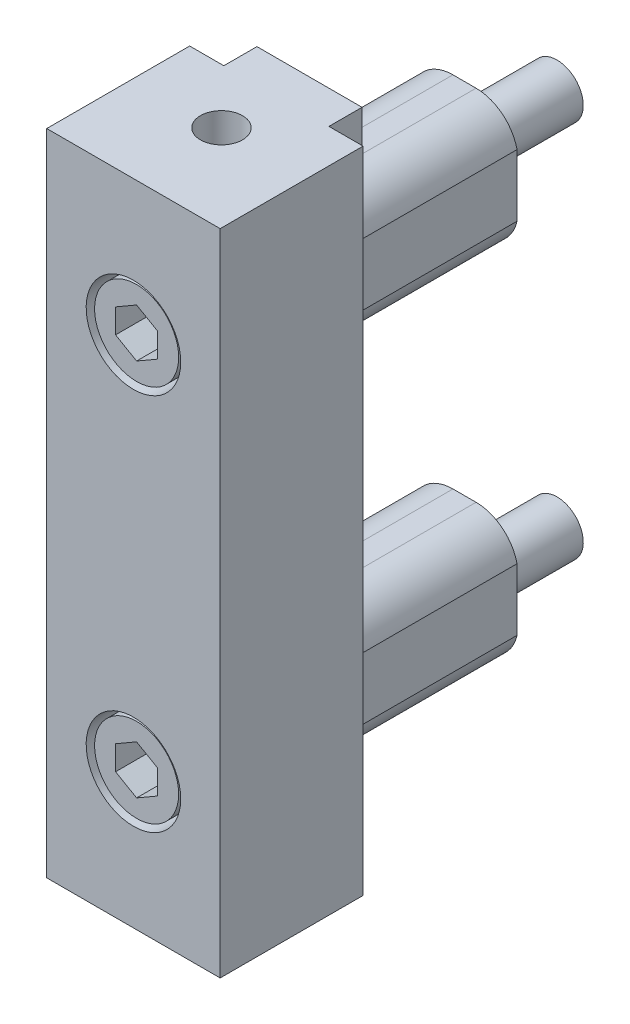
ISO-10303-21;
HEADER;
FILE_DESCRIPTION(('STEP AP214'),'2;1');
FILE_NAME('part.step','',(''),(''),'','','');
FILE_SCHEMA(('AUTOMOTIVE_DESIGN { 1 0 10303 214 1 1 1 1 }'));
ENDSEC;
DATA;
#1=APPLICATION_CONTEXT('core data for automotive mechanical design processes');
#2=APPLICATION_PROTOCOL_DEFINITION('international standard','automotive_design',2000,#1);
#3=PRODUCT_CONTEXT('',#1,'mechanical');
#4=PRODUCT('Part','Part','',(#3));
#5=PRODUCT_RELATED_PRODUCT_CATEGORY('part','',(#4));
#6=PRODUCT_DEFINITION_FORMATION('','',#4);
#7=PRODUCT_DEFINITION_CONTEXT('part definition',#1,'design');
#8=PRODUCT_DEFINITION('design','',#6,#7);
#9=PRODUCT_DEFINITION_SHAPE('','',#8);
#10=(LENGTH_UNIT() NAMED_UNIT(*) SI_UNIT(.MILLI.,.METRE.));
#11=(NAMED_UNIT(*) PLANE_ANGLE_UNIT() SI_UNIT($,.RADIAN.));
#12=(NAMED_UNIT(*) SI_UNIT($,.STERADIAN.) SOLID_ANGLE_UNIT());
#13=UNCERTAINTY_MEASURE_WITH_UNIT(LENGTH_MEASURE(1.E-05),#10,'distance_accuracy_value','');
#14=(GEOMETRIC_REPRESENTATION_CONTEXT(3) GLOBAL_UNCERTAINTY_ASSIGNED_CONTEXT((#13)) GLOBAL_UNIT_ASSIGNED_CONTEXT((#10,
#11,#12)) REPRESENTATION_CONTEXT('',''));
#15=CARTESIAN_POINT('',(0.,0.,0.));
#16=DIRECTION('',(0.,0.,1.));
#17=DIRECTION('',(1.,0.,0.));
#18=AXIS2_PLACEMENT_3D('',#15,#16,#17);
#19=CARTESIAN_POINT('',(-3.99999999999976,-42.9282032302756,25.8));
#20=DIRECTION('',(0.,0.,-1.));
#21=DIRECTION('',(0.,-1.,0.));
#22=AXIS2_PLACEMENT_3D('',#19,#20,#21);
#23=PLANE('',#22);
#24=DIRECTION('',(0.,1.,0.));
#25=VECTOR('',#24,1.);
#26=CARTESIAN_POINT('',(4.00000000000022,-38.3094010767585,25.8));
#27=LINE('',#26,#25);
#28=CARTESIAN_POINT('',(4.00000000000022,-38.3094010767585,25.8));
#29=VERTEX_POINT('',#28);
#30=CARTESIAN_POINT('',(4.00000000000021,-33.6905989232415,25.8));
#31=VERTEX_POINT('',#30);
#32=EDGE_CURVE('E1404',#29,#31,#27,.T.);
#33=ORIENTED_EDGE('',*,*,#32,.T.);
#34=DIRECTION('',(-0.866025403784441,0.5,0.));
#35=VECTOR('',#34,1.);
#36=CARTESIAN_POINT('',(4.00000000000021,-33.6905989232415,25.8));
#37=LINE('',#36,#35);
#38=CARTESIAN_POINT('',(1.99932661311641E-13,-31.381197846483,25.8));
#39=VERTEX_POINT('',#38);
#40=EDGE_CURVE('E1398',#31,#39,#37,.T.);
#41=ORIENTED_EDGE('',*,*,#40,.T.);
#42=DIRECTION('',(0.866025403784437,0.5,0.));
#43=VECTOR('',#42,1.);
#44=CARTESIAN_POINT('',(-3.9999999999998,-33.6905989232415,25.8));
#45=LINE('',#44,#43);
#46=CARTESIAN_POINT('',(-3.9999999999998,-33.6905989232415,25.8));
#47=VERTEX_POINT('',#46);
#48=EDGE_CURVE('E1395',#47,#39,#45,.T.);
#49=ORIENTED_EDGE('',*,*,#48,.F.);
#50=DIRECTION('',(0.,1.,0.));
#51=VECTOR('',#50,1.);
#52=CARTESIAN_POINT('',(-3.99999999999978,-38.3094010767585,25.8));
#53=LINE('',#52,#51);
#54=CARTESIAN_POINT('',(-3.99999999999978,-38.3094010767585,25.8));
#55=VERTEX_POINT('',#54);
#56=EDGE_CURVE('E1389',#55,#47,#53,.T.);
#57=ORIENTED_EDGE('',*,*,#56,.F.);
#58=DIRECTION('',(0.86602540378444,-0.5,0.));
#59=VECTOR('',#58,1.);
#60=CARTESIAN_POINT('',(-3.99999999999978,-38.3094010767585,25.8));
#61=LINE('',#60,#59);
#62=CARTESIAN_POINT('',(2.32008428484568E-13,-40.618802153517,25.8));
#63=VERTEX_POINT('',#62);
#64=EDGE_CURVE('E1367',#55,#63,#61,.T.);
#65=ORIENTED_EDGE('',*,*,#64,.T.);
#66=DIRECTION('',(-0.866025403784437,-0.5,0.));
#67=VECTOR('',#66,1.);
#68=CARTESIAN_POINT('',(4.00000000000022,-38.3094010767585,25.8));
#69=LINE('',#68,#67);
#70=EDGE_CURVE('E1373',#29,#63,#69,.T.);
#71=ORIENTED_EDGE('',*,*,#70,.F.);
#72=EDGE_LOOP('',(#33,#41,#49,#57,#65,#71));
#73=FACE_BOUND('',#72,.T.);
#74=ADVANCED_FACE('F16',(#73),#23,.F.);
#75=CARTESIAN_POINT('',(4.00000000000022,-38.3094010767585,25.8));
#76=DIRECTION('',(-0.5,0.866025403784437,0.));
#77=DIRECTION('',(-0.866025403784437,-0.5,0.));
#78=AXIS2_PLACEMENT_3D('',#75,#76,#77);
#79=PLANE('',#78);
#80=ORIENTED_EDGE('',*,*,#70,.T.);
#81=DIRECTION('',(0.,0.,1.));
#82=VECTOR('',#81,1.);
#83=CARTESIAN_POINT('',(2.31900008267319E-13,-40.618802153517,25.8));
#84=LINE('',#83,#82);
#85=CARTESIAN_POINT('',(2.57583992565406E-13,-40.618802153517,32.9));
#86=VERTEX_POINT('',#85);
#87=EDGE_CURVE('E1363',#63,#86,#84,.T.);
#88=ORIENTED_EDGE('',*,*,#87,.T.);
#89=DIRECTION('',(0.866025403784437,0.5,0.));
#90=VECTOR('',#89,1.);
#91=CARTESIAN_POINT('',(2.56689525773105E-13,-40.618802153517,32.9));
#92=LINE('',#91,#90);
#93=CARTESIAN_POINT('',(4.00000000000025,-38.3094010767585,32.9));
#94=VERTEX_POINT('',#93);
#95=EDGE_CURVE('E1409',#86,#94,#92,.T.);
#96=ORIENTED_EDGE('',*,*,#95,.T.);
#97=DIRECTION('',(0.,0.,1.));
#98=VECTOR('',#97,1.);
#99=CARTESIAN_POINT('',(4.00000000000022,-38.3094010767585,25.8));
#100=LINE('',#99,#98);
#101=EDGE_CURVE('E1377',#94,#29,#100,.F.);
#102=ORIENTED_EDGE('',*,*,#101,.T.);
#103=EDGE_LOOP('',(#80,#88,#96,#102));
#104=FACE_BOUND('',#103,.T.);
#105=ADVANCED_FACE('F725',(#104),#79,.T.);
#106=CARTESIAN_POINT('',(4.00000000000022,-38.3094010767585,25.8));
#107=DIRECTION('',(1.,0.,0.));
#108=DIRECTION('',(0.,1.,0.));
#109=AXIS2_PLACEMENT_3D('',#106,#107,#108);
#110=PLANE('',#109);
#111=DIRECTION('',(0.,0.,1.));
#112=VECTOR('',#111,1.);
#113=CARTESIAN_POINT('',(4.00000000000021,-33.6905989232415,25.8));
#114=LINE('',#113,#112);
#115=CARTESIAN_POINT('',(4.00000000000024,-33.6905989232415,32.9));
#116=VERTEX_POINT('',#115);
#117=EDGE_CURVE('E1401',#116,#31,#114,.F.);
#118=ORIENTED_EDGE('',*,*,#117,.T.);
#119=ORIENTED_EDGE('',*,*,#32,.F.);
#120=ORIENTED_EDGE('',*,*,#101,.F.);
#121=DIRECTION('',(0.,-1.,0.));
#122=VECTOR('',#121,1.);
#123=CARTESIAN_POINT('',(4.00000000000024,-36.,32.9));
#124=LINE('',#123,#122);
#125=EDGE_CURVE('E1372',#94,#116,#124,.F.);
#126=ORIENTED_EDGE('',*,*,#125,.T.);
#127=EDGE_LOOP('',(#118,#119,#120,#126));
#128=FACE_BOUND('',#127,.T.);
#129=ADVANCED_FACE('F732',(#128),#110,.F.);
#130=CARTESIAN_POINT('',(4.00000000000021,-33.6905989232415,25.8));
#131=DIRECTION('',(0.5,0.866025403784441,0.));
#132=DIRECTION('',(-0.866025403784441,0.5,0.));
#133=AXIS2_PLACEMENT_3D('',#130,#131,#132);
#134=PLANE('',#133);
#135=DIRECTION('',(0.,0.,1.));
#136=VECTOR('',#135,1.);
#137=CARTESIAN_POINT('',(1.99647085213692E-13,-31.381197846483,25.8));
#138=LINE('',#137,#136);
#139=CARTESIAN_POINT('',(2.24389655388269E-13,-31.381197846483,32.9));
#140=VERTEX_POINT('',#139);
#141=EDGE_CURVE('E1392',#39,#140,#138,.T.);
#142=ORIENTED_EDGE('',*,*,#141,.F.);
#143=ORIENTED_EDGE('',*,*,#40,.F.);
#144=ORIENTED_EDGE('',*,*,#117,.F.);
#145=DIRECTION('',(-0.866025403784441,0.5,0.));
#146=VECTOR('',#145,1.);
#147=CARTESIAN_POINT('',(4.00000000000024,-33.6905989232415,32.9));
#148=LINE('',#147,#146);
#149=EDGE_CURVE('E1551',#116,#140,#148,.T.);
#150=ORIENTED_EDGE('',*,*,#149,.T.);
#151=EDGE_LOOP('',(#142,#143,#144,#150));
#152=FACE_BOUND('',#151,.T.);
#153=ADVANCED_FACE('F1325',(#152),#134,.F.);
#154=CARTESIAN_POINT('',(-3.9999999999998,-33.6905989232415,25.8));
#155=DIRECTION('',(0.5,-0.866025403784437,0.));
#156=DIRECTION('',(0.866025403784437,0.5,0.));
#157=AXIS2_PLACEMENT_3D('',#154,#155,#156);
#158=PLANE('',#157);
#159=ORIENTED_EDGE('',*,*,#48,.T.);
#160=ORIENTED_EDGE('',*,*,#141,.T.);
#161=DIRECTION('',(-0.866025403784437,-0.5,0.));
#162=VECTOR('',#161,1.);
#163=CARTESIAN_POINT('',(2.24436602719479E-13,-31.381197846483,32.9));
#164=LINE('',#163,#162);
#165=CARTESIAN_POINT('',(-3.99999999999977,-33.6905989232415,32.9));
#166=VERTEX_POINT('',#165);
#167=EDGE_CURVE('E1547',#140,#166,#164,.T.);
#168=ORIENTED_EDGE('',*,*,#167,.T.);
#169=DIRECTION('',(0.,0.,1.));
#170=VECTOR('',#169,1.);
#171=CARTESIAN_POINT('',(-3.9999999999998,-33.6905989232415,25.8));
#172=LINE('',#171,#170);
#173=EDGE_CURVE('E1386',#47,#166,#172,.T.);
#174=ORIENTED_EDGE('',*,*,#173,.F.);
#175=EDGE_LOOP('',(#159,#160,#168,#174));
#176=FACE_BOUND('',#175,.T.);
#177=ADVANCED_FACE('F1334',(#176),#158,.T.);
#178=CARTESIAN_POINT('',(-3.99999999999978,-38.3094010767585,25.8));
#179=DIRECTION('',(1.,0.,0.));
#180=DIRECTION('',(0.,1.,0.));
#181=AXIS2_PLACEMENT_3D('',#178,#179,#180);
#182=PLANE('',#181);
#183=ORIENTED_EDGE('',*,*,#56,.T.);
#184=ORIENTED_EDGE('',*,*,#173,.T.);
#185=DIRECTION('',(0.,-1.,0.));
#186=VECTOR('',#185,1.);
#187=CARTESIAN_POINT('',(-3.99999999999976,-36.,32.9));
#188=LINE('',#187,#186);
#189=CARTESIAN_POINT('',(-3.99999999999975,-38.3094010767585,32.9));
#190=VERTEX_POINT('',#189);
#191=EDGE_CURVE('E1543',#166,#190,#188,.T.);
#192=ORIENTED_EDGE('',*,*,#191,.T.);
#193=DIRECTION('',(0.,0.,1.));
#194=VECTOR('',#193,1.);
#195=CARTESIAN_POINT('',(-3.99999999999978,-38.3094010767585,25.8));
#196=LINE('',#195,#194);
#197=EDGE_CURVE('E1383',#190,#55,#196,.F.);
#198=ORIENTED_EDGE('',*,*,#197,.T.);
#199=EDGE_LOOP('',(#183,#184,#192,#198));
#200=FACE_BOUND('',#199,.T.);
#201=ADVANCED_FACE('F1343',(#200),#182,.T.);
#202=CARTESIAN_POINT('',(-3.99999999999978,-38.3094010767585,25.8));
#203=DIRECTION('',(-0.5,-0.86602540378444,0.));
#204=DIRECTION('',(0.86602540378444,-0.5,0.));
#205=AXIS2_PLACEMENT_3D('',#202,#203,#204);
#206=PLANE('',#205);
#207=ORIENTED_EDGE('',*,*,#87,.F.);
#208=ORIENTED_EDGE('',*,*,#64,.F.);
#209=ORIENTED_EDGE('',*,*,#197,.F.);
#210=DIRECTION('',(0.86602540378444,-0.5,0.));
#211=VECTOR('',#210,1.);
#212=CARTESIAN_POINT('',(-3.99999999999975,-38.3094010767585,32.9));
#213=LINE('',#212,#211);
#214=EDGE_CURVE('E35',#190,#86,#213,.T.);
#215=ORIENTED_EDGE('',*,*,#214,.T.);
#216=EDGE_LOOP('',(#207,#208,#209,#215));
#217=FACE_BOUND('',#216,.T.);
#218=ADVANCED_FACE('F743',(#217),#206,.F.);
#219=CARTESIAN_POINT('',(-7.59999999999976,-36.,32.9));
#220=DIRECTION('',(0.,0.,-1.));
#221=DIRECTION('',(0.,-1.,0.));
#222=AXIS2_PLACEMENT_3D('',#219,#220,#221);
#223=PLANE('',#222);
#224=CARTESIAN_POINT('',(2.40563064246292E-13,-36.,32.9));
#225=DIRECTION('',(0.,0.,-1.));
#226=DIRECTION('',(0.,-1.,0.));
#227=AXIS2_PLACEMENT_3D('',#224,#225,#226);
#228=CIRCLE('',#227,8.);
#229=CARTESIAN_POINT('',(2.68494914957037E-13,-44.,32.9));
#230=VERTEX_POINT('',#229);
#231=EDGE_CURVE('E1408',#230,#230,#228,.T.);
#232=ORIENTED_EDGE('',*,*,#231,.F.);
#233=EDGE_LOOP('',(#232));
#234=FACE_BOUND('',#233,.T.);
#235=ORIENTED_EDGE('',*,*,#214,.F.);
#236=ORIENTED_EDGE('',*,*,#191,.F.);
#237=ORIENTED_EDGE('',*,*,#167,.F.);
#238=ORIENTED_EDGE('',*,*,#149,.F.);
#239=ORIENTED_EDGE('',*,*,#125,.F.);
#240=ORIENTED_EDGE('',*,*,#95,.F.);
#241=EDGE_LOOP('',(#235,#236,#237,#238,#239,#240));
#242=FACE_BOUND('',#241,.T.);
#243=ADVANCED_FACE('F739',(#234,#242),#223,.F.);
#244=CARTESIAN_POINT('',(2.0564825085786E-13,-36.,22.9));
#245=DIRECTION('',(0.,0.,1.));
#246=DIRECTION('',(0.,1.,0.));
#247=AXIS2_PLACEMENT_3D('',#244,#245,#246);
#248=CYLINDRICAL_SURFACE('',#247,8.);
#249=CARTESIAN_POINT('',(2.0564825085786E-13,-36.,22.9));
#250=DIRECTION('',(0.,0.,1.));
#251=DIRECTION('',(0.,1.,0.));
#252=AXIS2_PLACEMENT_3D('',#249,#250,#251);
#253=CIRCLE('',#252,8.);
#254=CARTESIAN_POINT('',(1.77716400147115E-13,-28.,22.9));
#255=VERTEX_POINT('',#254);
#256=EDGE_CURVE('E833',#255,#255,#253,.T.);
#257=ORIENTED_EDGE('',*,*,#256,.T.);
#258=EDGE_LOOP('',(#257));
#259=FACE_BOUND('',#258,.T.);
#260=ORIENTED_EDGE('',*,*,#231,.T.);
#261=EDGE_LOOP('',(#260));
#262=FACE_BOUND('',#261,.T.);
#263=ADVANCED_FACE('F742',(#259,#262),#248,.T.);
#264=CARTESIAN_POINT('',(-4.,29.0717967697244,25.8));
#265=DIRECTION('',(0.,0.,-1.));
#266=DIRECTION('',(0.,-1.,0.));
#267=AXIS2_PLACEMENT_3D('',#264,#265,#266);
#268=PLANE('',#267);
#269=DIRECTION('',(0.,1.,0.));
#270=VECTOR('',#269,1.);
#271=CARTESIAN_POINT('',(4.,33.6905989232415,25.8));
#272=LINE('',#271,#270);
#273=CARTESIAN_POINT('',(4.,33.6905989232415,25.8));
#274=VERTEX_POINT('',#273);
#275=CARTESIAN_POINT('',(3.99999999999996,38.3094010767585,25.8));
#276=VERTEX_POINT('',#275);
#277=EDGE_CURVE('E299',#274,#276,#272,.T.);
#278=ORIENTED_EDGE('',*,*,#277,.T.);
#279=DIRECTION('',(-0.866025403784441,0.5,0.));
#280=VECTOR('',#279,1.);
#281=CARTESIAN_POINT('',(3.99999999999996,38.3094010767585,25.8));
#282=LINE('',#281,#280);
#283=CARTESIAN_POINT('',(0.,40.618802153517,25.8));
#284=VERTEX_POINT('',#283);
#285=EDGE_CURVE('E1454',#276,#284,#282,.T.);
#286=ORIENTED_EDGE('',*,*,#285,.T.);
#287=DIRECTION('',(0.866025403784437,0.5,0.));
#288=VECTOR('',#287,1.);
#289=CARTESIAN_POINT('',(-4.00000000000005,38.3094010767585,25.8));
#290=LINE('',#289,#288);
#291=CARTESIAN_POINT('',(-4.00000000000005,38.3094010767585,25.8));
#292=VERTEX_POINT('',#291);
#293=EDGE_CURVE('E1451',#292,#284,#290,.T.);
#294=ORIENTED_EDGE('',*,*,#293,.F.);
#295=DIRECTION('',(0.,1.,0.));
#296=VECTOR('',#295,1.);
#297=CARTESIAN_POINT('',(-4.,33.6905989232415,25.8));
#298=LINE('',#297,#296);
#299=CARTESIAN_POINT('',(-4.,33.6905989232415,25.8));
#300=VERTEX_POINT('',#299);
#301=EDGE_CURVE('E1445',#300,#292,#298,.T.);
#302=ORIENTED_EDGE('',*,*,#301,.F.);
#303=DIRECTION('',(0.86602540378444,-0.5,0.));
#304=VECTOR('',#303,1.);
#305=CARTESIAN_POINT('',(-4.,33.6905989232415,25.8));
#306=LINE('',#305,#304);
#307=CARTESIAN_POINT('',(0.,31.381197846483,25.8));
#308=VERTEX_POINT('',#307);
#309=EDGE_CURVE('E1437',#300,#308,#306,.T.);
#310=ORIENTED_EDGE('',*,*,#309,.T.);
#311=DIRECTION('',(-0.866025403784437,-0.5,0.));
#312=VECTOR('',#311,1.);
#313=CARTESIAN_POINT('',(4.,33.6905989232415,25.8));
#314=LINE('',#313,#312);
#315=EDGE_CURVE('E1431',#274,#308,#314,.T.);
#316=ORIENTED_EDGE('',*,*,#315,.F.);
#317=EDGE_LOOP('',(#278,#286,#294,#302,#310,#316));
#318=FACE_BOUND('',#317,.T.);
#319=ADVANCED_FACE('F747',(#318),#268,.F.);
#320=CARTESIAN_POINT('',(4.,33.6905989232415,25.8));
#321=DIRECTION('',(-0.5,0.866025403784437,0.));
#322=DIRECTION('',(-0.866025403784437,-0.5,0.));
#323=AXIS2_PLACEMENT_3D('',#320,#321,#322);
#324=PLANE('',#323);
#325=ORIENTED_EDGE('',*,*,#315,.T.);
#326=DIRECTION('',(0.,0.,1.));
#327=VECTOR('',#326,1.);
#328=CARTESIAN_POINT('',(0.,31.381197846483,25.8));
#329=LINE('',#328,#327);
#330=CARTESIAN_POINT('',(0.,31.381197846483,32.9));
#331=VERTEX_POINT('',#330);
#332=EDGE_CURVE('E1428',#308,#331,#329,.T.);
#333=ORIENTED_EDGE('',*,*,#332,.T.);
#334=DIRECTION('',(0.866025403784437,0.5,0.));
#335=VECTOR('',#334,1.);
#336=CARTESIAN_POINT('',(0.,31.381197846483,32.9));
#337=LINE('',#336,#335);
#338=CARTESIAN_POINT('',(4.,33.6905989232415,32.9));
#339=VERTEX_POINT('',#338);
#340=EDGE_CURVE('E1414',#331,#339,#337,.T.);
#341=ORIENTED_EDGE('',*,*,#340,.T.);
#342=DIRECTION('',(0.,0.,1.));
#343=VECTOR('',#342,1.);
#344=CARTESIAN_POINT('',(4.,33.6905989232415,25.8));
#345=LINE('',#344,#343);
#346=EDGE_CURVE('E1434',#339,#274,#345,.F.);
#347=ORIENTED_EDGE('',*,*,#346,.T.);
#348=EDGE_LOOP('',(#325,#333,#341,#347));
#349=FACE_BOUND('',#348,.T.);
#350=ADVANCED_FACE('F758',(#349),#324,.T.);
#351=CARTESIAN_POINT('',(4.,33.6905989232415,25.8));
#352=DIRECTION('',(1.,0.,0.));
#353=DIRECTION('',(0.,1.,0.));
#354=AXIS2_PLACEMENT_3D('',#351,#352,#353);
#355=PLANE('',#354);
#356=DIRECTION('',(0.,0.,1.));
#357=VECTOR('',#356,1.);
#358=CARTESIAN_POINT('',(3.99999999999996,38.3094010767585,25.8));
#359=LINE('',#358,#357);
#360=CARTESIAN_POINT('',(4.,38.3094010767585,32.9));
#361=VERTEX_POINT('',#360);
#362=EDGE_CURVE('E1456',#361,#276,#359,.F.);
#363=ORIENTED_EDGE('',*,*,#362,.T.);
#364=ORIENTED_EDGE('',*,*,#277,.F.);
#365=ORIENTED_EDGE('',*,*,#346,.F.);
#366=DIRECTION('',(0.,-1.,0.));
#367=VECTOR('',#366,1.);
#368=CARTESIAN_POINT('',(4.,36.,32.9));
#369=LINE('',#368,#367);
#370=EDGE_CURVE('E1426',#339,#361,#369,.F.);
#371=ORIENTED_EDGE('',*,*,#370,.T.);
#372=EDGE_LOOP('',(#363,#364,#365,#371));
#373=FACE_BOUND('',#372,.T.);
#374=ADVANCED_FACE('F761',(#373),#355,.F.);
#375=CARTESIAN_POINT('',(3.99999999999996,38.3094010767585,25.8));
#376=DIRECTION('',(0.5,0.866025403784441,0.));
#377=DIRECTION('',(-0.866025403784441,0.5,0.));
#378=AXIS2_PLACEMENT_3D('',#375,#376,#377);
#379=PLANE('',#378);
#380=DIRECTION('',(0.,0.,1.));
#381=VECTOR('',#380,1.);
#382=CARTESIAN_POINT('',(0.,40.618802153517,25.8));
#383=LINE('',#382,#381);
#384=CARTESIAN_POINT('',(0.,40.618802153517,32.9));
#385=VERTEX_POINT('',#384);
#386=EDGE_CURVE('E1448',#284,#385,#383,.T.);
#387=ORIENTED_EDGE('',*,*,#386,.F.);
#388=ORIENTED_EDGE('',*,*,#285,.F.);
#389=ORIENTED_EDGE('',*,*,#362,.F.);
#390=DIRECTION('',(-0.866025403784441,0.5,0.));
#391=VECTOR('',#390,1.);
#392=CARTESIAN_POINT('',(4.,38.3094010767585,32.9));
#393=LINE('',#392,#391);
#394=EDGE_CURVE('E1424',#361,#385,#393,.T.);
#395=ORIENTED_EDGE('',*,*,#394,.T.);
#396=EDGE_LOOP('',(#387,#388,#389,#395));
#397=FACE_BOUND('',#396,.T.);
#398=ADVANCED_FACE('F775',(#397),#379,.F.);
#399=CARTESIAN_POINT('',(-4.00000000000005,38.3094010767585,25.8));
#400=DIRECTION('',(0.5,-0.866025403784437,0.));
#401=DIRECTION('',(0.866025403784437,0.5,0.));
#402=AXIS2_PLACEMENT_3D('',#399,#400,#401);
#403=PLANE('',#402);
#404=ORIENTED_EDGE('',*,*,#293,.T.);
#405=ORIENTED_EDGE('',*,*,#386,.T.);
#406=DIRECTION('',(-0.866025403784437,-0.5,0.));
#407=VECTOR('',#406,1.);
#408=CARTESIAN_POINT('',(0.,40.618802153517,32.9));
#409=LINE('',#408,#407);
#410=CARTESIAN_POINT('',(-4.,38.3094010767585,32.9));
#411=VERTEX_POINT('',#410);
#412=EDGE_CURVE('E1422',#385,#411,#409,.T.);
#413=ORIENTED_EDGE('',*,*,#412,.T.);
#414=DIRECTION('',(0.,0.,1.));
#415=VECTOR('',#414,1.);
#416=CARTESIAN_POINT('',(-4.00000000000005,38.3094010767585,25.8));
#417=LINE('',#416,#415);
#418=EDGE_CURVE('E1442',#292,#411,#417,.T.);
#419=ORIENTED_EDGE('',*,*,#418,.F.);
#420=EDGE_LOOP('',(#404,#405,#413,#419));
#421=FACE_BOUND('',#420,.T.);
#422=ADVANCED_FACE('F771',(#421),#403,.T.);
#423=CARTESIAN_POINT('',(-4.,33.6905989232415,25.8));
#424=DIRECTION('',(1.,0.,0.));
#425=DIRECTION('',(0.,1.,0.));
#426=AXIS2_PLACEMENT_3D('',#423,#424,#425);
#427=PLANE('',#426);
#428=ORIENTED_EDGE('',*,*,#301,.T.);
#429=ORIENTED_EDGE('',*,*,#418,.T.);
#430=DIRECTION('',(0.,-1.,0.));
#431=VECTOR('',#430,1.);
#432=CARTESIAN_POINT('',(-4.,36.,32.9));
#433=LINE('',#432,#431);
#434=CARTESIAN_POINT('',(-4.,33.6905989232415,32.9));
#435=VERTEX_POINT('',#434);
#436=EDGE_CURVE('E1420',#411,#435,#433,.T.);
#437=ORIENTED_EDGE('',*,*,#436,.T.);
#438=DIRECTION('',(0.,0.,1.));
#439=VECTOR('',#438,1.);
#440=CARTESIAN_POINT('',(-4.,33.6905989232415,25.8));
#441=LINE('',#440,#439);
#442=EDGE_CURVE('E1439',#435,#300,#441,.F.);
#443=ORIENTED_EDGE('',*,*,#442,.T.);
#444=EDGE_LOOP('',(#428,#429,#437,#443));
#445=FACE_BOUND('',#444,.T.);
#446=ADVANCED_FACE('F767',(#445),#427,.T.);
#447=CARTESIAN_POINT('',(-4.,33.6905989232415,25.8));
#448=DIRECTION('',(-0.5,-0.86602540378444,0.));
#449=DIRECTION('',(0.86602540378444,-0.5,0.));
#450=AXIS2_PLACEMENT_3D('',#447,#448,#449);
#451=PLANE('',#450);
#452=ORIENTED_EDGE('',*,*,#332,.F.);
#453=ORIENTED_EDGE('',*,*,#309,.F.);
#454=ORIENTED_EDGE('',*,*,#442,.F.);
#455=DIRECTION('',(0.86602540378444,-0.5,0.));
#456=VECTOR('',#455,1.);
#457=CARTESIAN_POINT('',(-4.,33.6905989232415,32.9));
#458=LINE('',#457,#456);
#459=EDGE_CURVE('E1418',#435,#331,#458,.T.);
#460=ORIENTED_EDGE('',*,*,#459,.T.);
#461=EDGE_LOOP('',(#452,#453,#454,#460));
#462=FACE_BOUND('',#461,.T.);
#463=ADVANCED_FACE('F763',(#462),#451,.F.);
#464=CARTESIAN_POINT('',(-7.6,36.,32.9));
#465=DIRECTION('',(0.,0.,-1.));
#466=DIRECTION('',(0.,-1.,0.));
#467=AXIS2_PLACEMENT_3D('',#464,#465,#466);
#468=PLANE('',#467);
#469=CARTESIAN_POINT('',(0.,36.,32.9));
#470=DIRECTION('',(0.,0.,-1.));
#471=DIRECTION('',(0.,-1.,0.));
#472=AXIS2_PLACEMENT_3D('',#469,#470,#471);
#473=CIRCLE('',#472,8.);
#474=CARTESIAN_POINT('',(0.,28.,32.9));
#475=VERTEX_POINT('',#474);
#476=EDGE_CURVE('E1462',#475,#475,#473,.T.);
#477=ORIENTED_EDGE('',*,*,#476,.F.);
#478=EDGE_LOOP('',(#477));
#479=FACE_BOUND('',#478,.T.);
#480=ORIENTED_EDGE('',*,*,#459,.F.);
#481=ORIENTED_EDGE('',*,*,#436,.F.);
#482=ORIENTED_EDGE('',*,*,#412,.F.);
#483=ORIENTED_EDGE('',*,*,#394,.F.);
#484=ORIENTED_EDGE('',*,*,#370,.F.);
#485=ORIENTED_EDGE('',*,*,#340,.F.);
#486=EDGE_LOOP('',(#480,#481,#482,#483,#484,#485));
#487=FACE_BOUND('',#486,.T.);
#488=ADVANCED_FACE('F766',(#479,#487),#468,.F.);
#489=CARTESIAN_POINT('',(0.,36.,22.9));
#490=DIRECTION('',(0.,0.,1.));
#491=DIRECTION('',(0.,1.,0.));
#492=AXIS2_PLACEMENT_3D('',#489,#490,#491);
#493=CYLINDRICAL_SURFACE('',#492,8.);
#494=CARTESIAN_POINT('',(0.,36.,22.9));
#495=DIRECTION('',(0.,0.,1.));
#496=DIRECTION('',(0.,1.,0.));
#497=AXIS2_PLACEMENT_3D('',#494,#495,#496);
#498=CIRCLE('',#497,8.);
#499=CARTESIAN_POINT('',(0.,44.,22.9));
#500=VERTEX_POINT('',#499);
#501=EDGE_CURVE('E1417',#500,#500,#498,.T.);
#502=ORIENTED_EDGE('',*,*,#501,.T.);
#503=EDGE_LOOP('',(#502));
#504=FACE_BOUND('',#503,.T.);
#505=ORIENTED_EDGE('',*,*,#476,.T.);
#506=EDGE_LOOP('',(#505));
#507=FACE_BOUND('',#506,.T.);
#508=ADVANCED_FACE('F788',(#504,#507),#493,.T.);
#509=CARTESIAN_POINT('',(-1.01252958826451E-13,45.75,16.75));
#510=DIRECTION('',(0.,1.,0.));
#511=DIRECTION('',(-1.,0.,0.));
#512=AXIS2_PLACEMENT_3D('',#509,#510,#511);
#513=PLANE('',#512);
#514=CARTESIAN_POINT('',(-1.01252958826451E-13,45.75,16.75));
#515=DIRECTION('',(0.,1.,0.));
#516=DIRECTION('',(-1.,0.,0.));
#517=AXIS2_PLACEMENT_3D('',#514,#515,#516);
#518=CIRCLE('',#517,4.);
#519=CARTESIAN_POINT('',(-4.0000000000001,45.75,16.75));
#520=VERTEX_POINT('',#519);
#521=EDGE_CURVE('E1470',#520,#520,#518,.T.);
#522=ORIENTED_EDGE('',*,*,#521,.T.);
#523=EDGE_LOOP('',(#522));
#524=FACE_BOUND('',#523,.T.);
#525=ADVANCED_FACE('F792',(#524),#513,.T.);
#526=CARTESIAN_POINT('',(2.18217583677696E-13,-45.75,16.75));
#527=DIRECTION('',(0.,-1.,0.));
#528=DIRECTION('',(1.,0.,0.));
#529=AXIS2_PLACEMENT_3D('',#526,#527,#528);
#530=PLANE('',#529);
#531=CARTESIAN_POINT('',(2.18217583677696E-13,-45.75,16.75));
#532=DIRECTION('',(0.,-1.,0.));
#533=DIRECTION('',(1.,0.,0.));
#534=AXIS2_PLACEMENT_3D('',#531,#532,#533);
#535=CIRCLE('',#534,4.);
#536=CARTESIAN_POINT('',(4.00000000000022,-45.75,16.75));
#537=VERTEX_POINT('',#536);
#538=EDGE_CURVE('E388',#537,#537,#535,.T.);
#539=ORIENTED_EDGE('',*,*,#538,.T.);
#540=EDGE_LOOP('',(#539));
#541=FACE_BOUND('',#540,.T.);
#542=ADVANCED_FACE('F798',(#541),#530,.T.);
#543=CARTESIAN_POINT('',(-3.0084107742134E-13,36.,-47.1));
#544=DIRECTION('',(0.,0.,1.));
#545=DIRECTION('',(0.,1.,0.));
#546=AXIS2_PLACEMENT_3D('',#543,#544,#545);
#547=PLANE('',#546);
#548=CARTESIAN_POINT('',(-2.92268549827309E-13,36.,-47.1));
#549=DIRECTION('',(0.,0.,1.));
#550=DIRECTION('',(0.,1.,0.));
#551=AXIS2_PLACEMENT_3D('',#548,#549,#550);
#552=CIRCLE('',#551,5.);
#553=CARTESIAN_POINT('',(-3.09725956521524E-13,41.,-47.1));
#554=VERTEX_POINT('',#553);
#555=EDGE_CURVE('E1465',#554,#554,#552,.T.);
#556=ORIENTED_EDGE('',*,*,#555,.F.);
#557=EDGE_LOOP('',(#556));
#558=FACE_BOUND('',#557,.T.);
#559=ADVANCED_FACE('F794',(#558),#547,.F.);
#560=CARTESIAN_POINT('',(0.,45.,22.9));
#561=DIRECTION('',(0.,0.,-1.));
#562=DIRECTION('',(-1.,0.,0.));
#563=AXIS2_PLACEMENT_3D('',#560,#561,#562);
#564=PLANE('',#563);
#565=ORIENTED_EDGE('',*,*,#501,.F.);
#566=EDGE_LOOP('',(#565));
#567=FACE_BOUND('',#566,.T.);
#568=CARTESIAN_POINT('',(0.,36.,22.9));
#569=DIRECTION('',(0.,0.,1.));
#570=DIRECTION('',(1.,0.,0.));
#571=AXIS2_PLACEMENT_3D('',#568,#569,#570);
#572=CIRCLE('',#571,9.);
#573=CARTESIAN_POINT('',(8.99999999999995,36.,22.9));
#574=VERTEX_POINT('',#573);
#575=EDGE_CURVE('E395',#574,#574,#572,.T.);
#576=ORIENTED_EDGE('',*,*,#575,.T.);
#577=EDGE_LOOP('',(#576));
#578=FACE_BOUND('',#577,.T.);
#579=ADVANCED_FACE('F797',(#567,#578),#564,.F.);
#580=CARTESIAN_POINT('',(13.6828427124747,-33.,-1.10000000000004));
#581=DIRECTION('',(-1.,0.,0.));
#582=DIRECTION('',(0.,0.,1.));
#583=AXIS2_PLACEMENT_3D('',#580,#581,#582);
#584=CONICAL_SURFACE('',#583,8.86715728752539,0.78539816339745);
#585=DIRECTION('',(-0.707106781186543,0.,0.707106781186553));
#586=VECTOR('',#585,1.);
#587=CARTESIAN_POINT('',(13.6828427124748,-33.,7.76715728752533));
#588=LINE('',#587,#586);
#589=CARTESIAN_POINT('',(15.15,-33.,6.3));
#590=VERTEX_POINT('',#589);
#591=CARTESIAN_POINT('',(13.4000000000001,-33.,8.05));
#592=VERTEX_POINT('',#591);
#593=EDGE_CURVE('E353',#590,#592,#588,.T.);
#594=ORIENTED_EDGE('',*,*,#593,.F.);
#595=CARTESIAN_POINT('',(-21.3961429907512,-76.3186274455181,6.30000000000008));
#596=CARTESIAN_POINT('',(-20.3429104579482,-75.2501016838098,6.3000000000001));
#597=CARTESIAN_POINT('',(-19.2902033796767,-74.1810571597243,6.3000000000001));
#598=CARTESIAN_POINT('',(-17.1851073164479,-72.0404568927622,6.3000000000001));
#599=CARTESIAN_POINT('',(-16.132719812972,-70.9688996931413,6.30000000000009));
#600=CARTESIAN_POINT('',(-14.0120611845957,-68.8060084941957,6.30000000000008));
#601=CARTESIAN_POINT('',(-12.9438203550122,-67.7146447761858,6.30000000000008));
#602=CARTESIAN_POINT('',(-11.3438437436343,-66.076371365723,6.30000000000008));
#603=CARTESIAN_POINT('',(-10.8111901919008,-65.5303579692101,6.30000000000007));
#604=CARTESIAN_POINT('',(-9.74660826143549,-64.4376535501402,6.30000000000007));
#605=CARTESIAN_POINT('',(-9.21467986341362,-63.8909625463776,6.30000000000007));
#606=CARTESIAN_POINT('',(-7.6904477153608,-62.3220651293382,6.30000000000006));
#607=CARTESIAN_POINT('',(-6.69916934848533,-61.2988619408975,6.30000000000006));
#608=CARTESIAN_POINT('',(-4.72038081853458,-59.2485445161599,6.30000000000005));
#609=CARTESIAN_POINT('',(-3.73287118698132,-58.2214297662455,6.30000000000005));
#610=CARTESIAN_POINT('',(-2.25370402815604,-56.6745937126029,6.30000000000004));
#611=CARTESIAN_POINT('',(-1.75996526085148,-56.1568627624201,6.30000000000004));
#612=CARTESIAN_POINT('',(-0.774200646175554,-55.1197731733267,6.30000000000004));
#613=CARTESIAN_POINT('',(-0.282174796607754,-54.6004145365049,6.30000000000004));
#614=CARTESIAN_POINT('',(0.699519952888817,-53.5599892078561,6.30000000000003));
#615=CARTESIAN_POINT('',(1.18918995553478,-53.0389235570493,6.30000000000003));
#616=CARTESIAN_POINT('',(2.16591115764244,-51.9943517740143,6.30000000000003));
#617=CARTESIAN_POINT('',(2.65296238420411,-51.4708456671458,6.30000000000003));
#618=CARTESIAN_POINT('',(3.61577624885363,-50.4293892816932,6.30000000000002));
#619=CARTESIAN_POINT('',(4.09159290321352,-49.9114889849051,6.30000000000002));
#620=CARTESIAN_POINT('',(5.0391122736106,-48.8718935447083,6.30000000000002));
#621=CARTESIAN_POINT('',(5.51081481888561,-48.3501982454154,6.30000000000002));
#622=CARTESIAN_POINT('',(6.44973266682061,-47.3008272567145,6.30000000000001));
#623=CARTESIAN_POINT('',(6.91693662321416,-46.7731414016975,6.30000000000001));
#624=CARTESIAN_POINT('',(7.84385830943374,-45.7113326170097,6.30000000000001));
#625=CARTESIAN_POINT('',(8.30357705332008,-45.1772105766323,6.30000000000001));
#626=CARTESIAN_POINT('',(8.98333917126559,-44.3716587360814,6.3));
#627=CARTESIAN_POINT('',(9.20734798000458,-44.1035754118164,6.3));
#628=CARTESIAN_POINT('',(9.65223340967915,-43.5648248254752,6.3));
#629=CARTESIAN_POINT('',(9.87311007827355,-43.2941576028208,6.3));
#630=CARTESIAN_POINT('',(10.3111970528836,-42.749588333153,6.3));
#631=CARTESIAN_POINT('',(10.5284049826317,-42.4756843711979,6.3));
#632=CARTESIAN_POINT('',(10.9581187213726,-41.9242140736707,6.3));
#633=CARTESIAN_POINT('',(11.1706246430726,-41.6466478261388,6.3));
#634=CARTESIAN_POINT('',(11.5890077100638,-41.0881072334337,6.29999999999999));
#635=CARTESIAN_POINT('',(11.7949059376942,-40.8071487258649,6.29999999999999));
#636=CARTESIAN_POINT('',(12.1993237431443,-40.239895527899,6.29999999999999));
#637=CARTESIAN_POINT('',(12.3978424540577,-39.953600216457,6.29999999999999));
#638=CARTESIAN_POINT('',(12.7850977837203,-39.3749131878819,6.29999999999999));
#639=CARTESIAN_POINT('',(12.9738452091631,-39.082528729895,6.29999999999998));
#640=CARTESIAN_POINT('',(13.3387940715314,-38.4900648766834,6.3));
#641=CARTESIAN_POINT('',(13.5149997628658,-38.1899881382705,6.30000000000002));
#642=CARTESIAN_POINT('',(13.7197233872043,-37.8183901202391,6.3));
#643=CARTESIAN_POINT('',(13.7562002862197,-37.7512261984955,6.29999999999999));
#644=CARTESIAN_POINT('',(13.828294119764,-37.6164275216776,6.29999999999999));
#645=CARTESIAN_POINT('',(13.8639109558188,-37.5487927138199,6.29999999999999));
#646=CARTESIAN_POINT('',(13.934231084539,-37.4130312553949,6.29999999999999));
#647=CARTESIAN_POINT('',(13.9689341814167,-37.3449045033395,6.29999999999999));
#648=CARTESIAN_POINT('',(14.0373556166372,-37.2081609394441,6.29999999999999));
#649=CARTESIAN_POINT('',(14.0710739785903,-37.1395441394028,6.29999999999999));
#650=CARTESIAN_POINT('',(14.1706611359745,-36.9329239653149,6.29999999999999));
#651=CARTESIAN_POINT('',(14.2349587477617,-36.7941570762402,6.29999999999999));
#652=CARTESIAN_POINT('',(14.3587806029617,-36.5145117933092,6.29999999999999));
#653=CARTESIAN_POINT('',(14.4183049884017,-36.373633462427,6.29999999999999));
#654=CARTESIAN_POINT('',(14.5306429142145,-36.0929338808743,6.29999999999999));
#655=CARTESIAN_POINT('',(14.5835786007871,-35.9531618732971,6.29999999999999));
#656=CARTESIAN_POINT('',(14.6836231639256,-35.6715603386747,6.29999999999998));
#657=CARTESIAN_POINT('',(14.7307318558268,-35.5297307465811,6.29999999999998));
#658=CARTESIAN_POINT('',(14.8622264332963,-35.1013158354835,6.29999999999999));
#659=CARTESIAN_POINT('',(14.9368738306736,-34.8115775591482,6.30000000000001));
#660=CARTESIAN_POINT('',(15.0207335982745,-34.3945340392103,6.3));
#661=CARTESIAN_POINT('',(15.042877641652,-34.2697345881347,6.29999999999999));
#662=CARTESIAN_POINT('',(15.0811609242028,-34.0192435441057,6.29999999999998));
#663=CARTESIAN_POINT('',(15.0973021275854,-33.8935522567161,6.29999999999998));
#664=CARTESIAN_POINT('',(15.1234477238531,-33.6400991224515,6.29999999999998));
#665=CARTESIAN_POINT('',(15.1333808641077,-33.5123299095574,6.29999999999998));
#666=CARTESIAN_POINT('',(15.1466694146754,-33.2563766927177,6.29999999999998));
#667=CARTESIAN_POINT('',(15.1500210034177,-33.1281924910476,6.29999999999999));
#668=CARTESIAN_POINT('',(15.15,-33.,6.3));
#669=B_SPLINE_CURVE_WITH_KNOTS('',3,(#595,#596,#597,#598,#599,#600,#601,#602,#603,#604,#605,
#606,#607,#608,#609,#610,#611,#612,#613,#614,#615,#616,#617,#618,#619,#620,#621,#622,#623,#624,
#625,#626,#627,#628,#629,#630,#631,#632,#633,#634,#635,#636,#637,#638,#639,#640,#641,#642,#643,
#644,#645,#646,#647,#648,#649,#650,#651,#652,#653,#654,#655,#656,#657,#658,#659,#660,#661,#662,
#663,#664,#665,#666,#667,#668),.UNSPECIFIED.,.F.,.F.,(4,2,2,2,2,2,2,2,2,2,2,2,2,2,2,2,2,2,2,2,2,
2,2,2,2,2,2,2,2,2,2,2,2,2,2,2,4),(0.,4.50104660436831,9.00679589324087,13.5882682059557,
15.8766412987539,18.1649522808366,22.4388427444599,26.7133152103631,28.859567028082,
31.0058160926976,33.1509372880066,35.2960362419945,37.4059011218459,39.5158531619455,
41.6301847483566,43.7442274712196,44.7922728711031,45.8403023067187,46.8889863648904,
47.9376452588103,48.9825345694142,50.027546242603,51.0713763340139,52.1148506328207,
52.3441366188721,52.5734487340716,52.8028095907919,53.0321649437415,53.4908968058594,
53.9496150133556,54.3978650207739,54.8461292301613,55.7419244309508,56.122060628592,
56.50207233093,56.886369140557,57.2708890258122),.UNSPECIFIED.);
#670=CARTESIAN_POINT('',(13.4000000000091,-38.3816818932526,6.3));
#671=VERTEX_POINT('',#670);
#672=EDGE_CURVE('E667',#671,#590,#669,.T.);
#673=ORIENTED_EDGE('',*,*,#672,.F.);
#674=CARTESIAN_POINT('',(13.4,-33.,-1.10000000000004));
#675=DIRECTION('',(-1.,0.,0.));
#676=DIRECTION('',(0.,0.,1.));
#677=AXIS2_PLACEMENT_3D('',#674,#675,#676);
#678=CIRCLE('',#677,9.15);
#679=EDGE_CURVE('E587',#671,#592,#678,.T.);
#680=ORIENTED_EDGE('',*,*,#679,.T.);
#681=EDGE_LOOP('',(#594,#673,#680));
#682=FACE_BOUND('',#681,.T.);
#683=ADVANCED_FACE('F704',(#682),#584,.F.);
#684=CARTESIAN_POINT('',(13.1171572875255,-33.,-1.10000000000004));
#685=DIRECTION('',(1.,0.,0.));
#686=DIRECTION('',(0.,1.,0.));
#687=AXIS2_PLACEMENT_3D('',#684,#685,#686);
#688=CONICAL_SURFACE('',#687,8.86715728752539,0.785398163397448);
#689=DIRECTION('',(-0.707106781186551,0.,-0.707106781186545));
#690=VECTOR('',#689,1.);
#691=CARTESIAN_POINT('',(13.1171572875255,-33.,7.76715728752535));
#692=LINE('',#691,#690);
#693=CARTESIAN_POINT('',(11.6500000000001,-33.,6.3));
#694=VERTEX_POINT('',#693);
#695=EDGE_CURVE('E357',#592,#694,#692,.T.);
#696=ORIENTED_EDGE('',*,*,#695,.F.);
#697=ORIENTED_EDGE('',*,*,#679,.F.);
#698=CARTESIAN_POINT('',(11.6500000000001,-33.,6.3));
#699=CARTESIAN_POINT('',(11.6499868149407,-33.1136307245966,6.3));
#700=CARTESIAN_POINT('',(11.6526169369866,-33.2272569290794,6.3));
#701=CARTESIAN_POINT('',(11.6630658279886,-33.4542530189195,6.29999999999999));
#702=CARTESIAN_POINT('',(11.6708837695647,-33.5676229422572,6.29999999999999));
#703=CARTESIAN_POINT('',(11.691590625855,-33.7936798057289,6.29999999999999));
#704=CARTESIAN_POINT('',(11.7044698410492,-33.9063676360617,6.29999999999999));
#705=CARTESIAN_POINT('',(11.7351138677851,-34.1310722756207,6.29999999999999));
#706=CARTESIAN_POINT('',(11.752878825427,-34.2430890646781,6.29999999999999));
#707=CARTESIAN_POINT('',(11.8125784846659,-34.5745864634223,6.29999999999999));
#708=CARTESIAN_POINT('',(11.8612401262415,-34.7928819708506,6.29999999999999));
#709=CARTESIAN_POINT('',(11.9745310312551,-35.2253112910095,6.3));
#710=CARTESIAN_POINT('',(12.0391675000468,-35.439443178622,6.3));
#711=CARTESIAN_POINT('',(12.1758458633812,-35.8446786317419,6.3));
#712=CARTESIAN_POINT('',(12.2467575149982,-36.0361673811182,6.29999999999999));
#713=CARTESIAN_POINT('',(12.3982279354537,-36.415232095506,6.29999999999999));
#714=CARTESIAN_POINT('',(12.4787853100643,-36.6028086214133,6.29999999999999));
#715=CARTESIAN_POINT('',(12.6483572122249,-36.9749132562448,6.29999999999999));
#716=CARTESIAN_POINT('',(12.7374018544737,-37.15942755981,6.29999999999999));
#717=CARTESIAN_POINT('',(12.9223836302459,-37.5249398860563,6.29999999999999));
#718=CARTESIAN_POINT('',(13.0183204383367,-37.7059380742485,6.3));
#719=CARTESIAN_POINT('',(13.222278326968,-38.0761340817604,6.3));
#720=CARTESIAN_POINT('',(13.3306799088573,-38.2651215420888,6.29999999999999));
#721=CARTESIAN_POINT('',(13.5529674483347,-38.6398539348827,6.29999999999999));
#722=CARTESIAN_POINT('',(13.6668539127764,-38.8255985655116,6.29999999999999));
#723=CARTESIAN_POINT('',(13.8992677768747,-39.194259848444,6.29999999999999));
#724=CARTESIAN_POINT('',(14.0177970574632,-39.3771753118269,6.29999999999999));
#725=CARTESIAN_POINT('',(14.2587445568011,-39.7404311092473,6.29999999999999));
#726=CARTESIAN_POINT('',(14.3811629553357,-39.9207713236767,6.29999999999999));
#727=CARTESIAN_POINT('',(14.7537561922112,-40.4589693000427,6.29999999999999));
#728=CARTESIAN_POINT('',(15.0088830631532,-40.8134006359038,6.29999999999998));
#729=CARTESIAN_POINT('',(15.5287289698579,-41.5149901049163,6.29999999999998));
#730=CARTESIAN_POINT('',(15.7934460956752,-41.8621496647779,6.29999999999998));
#731=CARTESIAN_POINT('',(16.3323960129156,-42.553615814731,6.29999999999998));
#732=CARTESIAN_POINT('',(16.6066894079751,-42.8978750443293,6.29999999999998));
#733=CARTESIAN_POINT('',(17.1609937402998,-43.581768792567,6.29999999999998));
#734=CARTESIAN_POINT('',(17.4410049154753,-43.9214031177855,6.29999999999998));
#735=CARTESIAN_POINT('',(18.0051999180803,-44.5965442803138,6.29999999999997));
#736=CARTESIAN_POINT('',(18.2893787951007,-44.9320552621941,6.29999999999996));
#737=CARTESIAN_POINT('',(18.8613077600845,-45.6000021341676,6.29999999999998));
#738=CARTESIAN_POINT('',(19.1490577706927,-45.9324380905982,6.3));
#739=CARTESIAN_POINT('',(19.7315146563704,-46.5994142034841,6.3));
#740=CARTESIAN_POINT('',(20.0262625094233,-46.9339185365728,6.29999999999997));
#741=CARTESIAN_POINT('',(20.6182126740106,-47.6007495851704,6.29999999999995));
#742=CARTESIAN_POINT('',(20.9154150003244,-47.9330762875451,6.29999999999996));
#743=CARTESIAN_POINT('',(21.8100735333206,-48.9273410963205,6.29999999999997));
#744=CARTESIAN_POINT('',(22.4105662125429,-49.5865467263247,6.29999999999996));
#745=CARTESIAN_POINT('',(23.6173472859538,-50.8997446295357,6.29999999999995));
#746=CARTESIAN_POINT('',(24.2236362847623,-51.5537363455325,6.29999999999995));
#747=CARTESIAN_POINT('',(25.4404623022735,-52.8577594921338,6.29999999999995));
#748=CARTESIAN_POINT('',(26.0509993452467,-53.5077909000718,6.29999999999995));
#749=CARTESIAN_POINT('',(27.2758213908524,-54.8053732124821,6.29999999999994));
#750=CARTESIAN_POINT('',(27.890109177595,-55.4529214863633,6.29999999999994));
#751=CARTESIAN_POINT('',(29.1211924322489,-56.745632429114,6.29999999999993));
#752=CARTESIAN_POINT('',(29.7379879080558,-57.3907950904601,6.29999999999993));
#753=CARTESIAN_POINT('',(30.9735222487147,-58.6791738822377,6.29999999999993));
#754=CARTESIAN_POINT('',(31.5922609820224,-59.3223901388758,6.29999999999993));
#755=CARTESIAN_POINT('',(32.8313398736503,-60.6072782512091,6.29999999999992));
#756=CARTESIAN_POINT('',(33.4516800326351,-61.2489501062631,6.29999999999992));
#757=CARTESIAN_POINT('',(35.2441111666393,-63.0992597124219,6.29999999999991));
#758=CARTESIAN_POINT('',(36.4178650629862,-64.3062864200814,6.29999999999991));
#759=CARTESIAN_POINT('',(38.7686542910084,-66.7171852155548,6.2999999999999));
#760=CARTESIAN_POINT('',(39.9456896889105,-67.9210572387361,6.2999999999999));
#761=CARTESIAN_POINT('',(42.3006198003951,-70.3248987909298,6.29999999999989));
#762=CARTESIAN_POINT('',(43.4785114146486,-71.5248713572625,6.29999999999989));
#763=CARTESIAN_POINT('',(45.8361017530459,-73.922983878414,6.29999999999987));
#764=CARTESIAN_POINT('',(47.0158004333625,-75.1211238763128,6.29999999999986));
#765=CARTESIAN_POINT('',(48.196142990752,-76.3186274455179,6.29999999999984));
#766=B_SPLINE_CURVE_WITH_KNOTS('',3,(#698,#699,#700,#701,#702,#703,#704,#705,#706,#707,#708,
#709,#710,#711,#712,#713,#714,#715,#716,#717,#718,#719,#720,#721,#722,#723,#724,#725,#726,#727,
#728,#729,#730,#731,#732,#733,#734,#735,#736,#737,#738,#739,#740,#741,#742,#743,#744,#745,#746,
#747,#748,#749,#750,#751,#752,#753,#754,#755,#756,#757,#758,#759,#760,#761,#762,#763,#764,#765),
.UNSPECIFIED.,.F.,.F.,(4,2,2,2,2,2,2,2,2,2,2,2,2,2,2,2,2,2,2,2,2,2,2,2,2,2,2,2,2,2,2,2,2,4),(0.,
0.34085424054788,0.681654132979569,1.02180407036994,1.36196418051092,2.03216755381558,
2.70267377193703,3.31496330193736,3.92716443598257,4.54162495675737,5.15605648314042,
5.80955445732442,6.46311293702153,7.11693898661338,7.77079530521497,9.08065629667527,
10.3902578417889,11.7106933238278,13.0311838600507,14.3502158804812,15.6692193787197,
17.0067117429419,18.3442121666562,21.0192815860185,23.6946331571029,26.3700000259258,
29.0476800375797,31.725368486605,34.4028794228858,37.0803914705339,42.1312729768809,
47.1822571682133,52.226684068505,57.2709905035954),.UNSPECIFIED.);
#767=EDGE_CURVE('E670',#694,#671,#766,.T.);
#768=ORIENTED_EDGE('',*,*,#767,.F.);
#769=EDGE_LOOP('',(#696,#697,#768));
#770=FACE_BOUND('',#769,.T.);
#771=ADVANCED_FACE('F690',(#770),#688,.F.);
#772=CARTESIAN_POINT('',(11.6500000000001,-33.,6.3));
#773=DIRECTION('',(0.707106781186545,0.,-0.707106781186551));
#774=DIRECTION('',(-0.707106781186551,0.,-0.707106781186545));
#775=AXIS2_PLACEMENT_3D('',#772,#773,#774);
#776=PLANE('',#775);
#777=ORIENTED_EDGE('',*,*,#695,.T.);
#778=DIRECTION('',(0.,1.,0.));
#779=VECTOR('',#778,1.);
#780=CARTESIAN_POINT('',(11.6499999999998,61.75,6.3));
#781=LINE('',#780,#779);
#782=CARTESIAN_POINT('',(11.65,33.,6.3));
#783=VERTEX_POINT('',#782);
#784=EDGE_CURVE('E668',#783,#694,#781,.F.);
#785=ORIENTED_EDGE('',*,*,#784,.F.);
#786=DIRECTION('',(-0.707106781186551,0.,-0.707106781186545));
#787=VECTOR('',#786,1.);
#788=CARTESIAN_POINT('',(11.65,33.,6.3));
#789=LINE('',#788,#787);
#790=CARTESIAN_POINT('',(13.4,33.,8.05));
#791=VERTEX_POINT('',#790);
#792=EDGE_CURVE('E361',#783,#791,#789,.F.);
#793=ORIENTED_EDGE('',*,*,#792,.T.);
#794=DIRECTION('',(0.,1.,0.));
#795=VECTOR('',#794,1.);
#796=CARTESIAN_POINT('',(13.4000000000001,-33.,8.05));
#797=LINE('',#796,#795);
#798=EDGE_CURVE('E592',#592,#791,#797,.T.);
#799=ORIENTED_EDGE('',*,*,#798,.F.);
#800=EDGE_LOOP('',(#777,#785,#793,#799));
#801=FACE_BOUND('',#800,.T.);
#802=ADVANCED_FACE('F685',(#801),#776,.T.);
#803=CARTESIAN_POINT('',(13.1171572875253,33.,-1.10000000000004));
#804=DIRECTION('',(1.,0.,0.));
#805=DIRECTION('',(0.,0.,-1.));
#806=AXIS2_PLACEMENT_3D('',#803,#804,#805);
#807=CONICAL_SURFACE('',#806,8.86715728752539,0.785398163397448);
#808=ORIENTED_EDGE('',*,*,#792,.F.);
#809=CARTESIAN_POINT('',(48.1961429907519,76.3186274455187,6.29999999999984));
#810=CARTESIAN_POINT('',(47.1429104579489,75.2501016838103,6.29999999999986));
#811=CARTESIAN_POINT('',(46.0902033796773,74.1810571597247,6.29999999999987));
#812=CARTESIAN_POINT('',(43.9851073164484,72.0404568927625,6.29999999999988));
#813=CARTESIAN_POINT('',(42.9327198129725,70.9688996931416,6.29999999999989));
#814=CARTESIAN_POINT('',(40.812061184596,68.8060084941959,6.29999999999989));
#815=CARTESIAN_POINT('',(39.7438203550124,67.7146447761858,6.2999999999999));
#816=CARTESIAN_POINT('',(38.1438437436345,66.0763713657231,6.2999999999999));
#817=CARTESIAN_POINT('',(37.6111901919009,65.5303579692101,6.2999999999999));
#818=CARTESIAN_POINT('',(36.5466082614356,64.4376535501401,6.29999999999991));
#819=CARTESIAN_POINT('',(36.0146798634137,63.8909625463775,6.29999999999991));
#820=CARTESIAN_POINT('',(34.4904477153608,62.322065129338,6.29999999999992));
#821=CARTESIAN_POINT('',(33.4991693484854,61.2988619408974,6.29999999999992));
#822=CARTESIAN_POINT('',(31.5203808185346,59.2485445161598,6.29999999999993));
#823=CARTESIAN_POINT('',(30.5328711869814,58.2214297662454,6.29999999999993));
#824=CARTESIAN_POINT('',(29.0537040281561,56.6745937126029,6.29999999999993));
#825=CARTESIAN_POINT('',(28.5599652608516,56.15686276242,6.29999999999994));
#826=CARTESIAN_POINT('',(27.5742006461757,55.1197731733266,6.29999999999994));
#827=CARTESIAN_POINT('',(27.0821747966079,54.6004145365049,6.29999999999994));
#828=CARTESIAN_POINT('',(26.1004800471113,53.5599892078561,6.29999999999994));
#829=CARTESIAN_POINT('',(25.6108100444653,53.0389235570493,6.29999999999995));
#830=CARTESIAN_POINT('',(24.6340888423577,51.9943517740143,6.29999999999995));
#831=CARTESIAN_POINT('',(24.147037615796,51.4708456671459,6.29999999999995));
#832=CARTESIAN_POINT('',(23.1842237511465,50.4293892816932,6.29999999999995));
#833=CARTESIAN_POINT('',(22.7084070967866,49.9114889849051,6.29999999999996));
#834=CARTESIAN_POINT('',(21.7608877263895,48.8718935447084,6.29999999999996));
#835=CARTESIAN_POINT('',(21.2891851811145,48.3501982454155,6.29999999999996));
#836=CARTESIAN_POINT('',(20.3502673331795,47.3008272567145,6.29999999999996));
#837=CARTESIAN_POINT('',(19.883063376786,46.7731414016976,6.29999999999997));
#838=CARTESIAN_POINT('',(18.9561416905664,45.7113326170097,6.29999999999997));
#839=CARTESIAN_POINT('',(18.4964229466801,45.1772105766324,6.29999999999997));
#840=CARTESIAN_POINT('',(17.8166608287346,44.3716587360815,6.29999999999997));
#841=CARTESIAN_POINT('',(17.5926520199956,44.1035754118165,6.29999999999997));
#842=CARTESIAN_POINT('',(17.147766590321,43.5648248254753,6.29999999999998));
#843=CARTESIAN_POINT('',(16.9268899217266,43.2941576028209,6.29999999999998));
#844=CARTESIAN_POINT('',(16.4888029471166,42.7495883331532,6.29999999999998));
#845=CARTESIAN_POINT('',(16.2715950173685,42.4756843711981,6.29999999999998));
#846=CARTESIAN_POINT('',(15.8418812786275,41.9242140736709,6.29999999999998));
#847=CARTESIAN_POINT('',(15.6293753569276,41.6466478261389,6.29999999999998));
#848=CARTESIAN_POINT('',(15.2109922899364,41.0881072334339,6.29999999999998));
#849=CARTESIAN_POINT('',(15.0050940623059,40.8071487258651,6.29999999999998));
#850=CARTESIAN_POINT('',(14.6006762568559,40.2398955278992,6.29999999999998));
#851=CARTESIAN_POINT('',(14.4021575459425,39.9536002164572,6.29999999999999));
#852=CARTESIAN_POINT('',(14.0149022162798,39.3749131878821,6.29999999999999));
#853=CARTESIAN_POINT('',(13.8261547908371,39.0825287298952,6.29999999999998));
#854=CARTESIAN_POINT('',(13.4612059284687,38.4900648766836,6.29999999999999));
#855=CARTESIAN_POINT('',(13.2850002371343,38.1899881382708,6.30000000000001));
#856=CARTESIAN_POINT('',(13.0802766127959,37.8183901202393,6.3));
#857=CARTESIAN_POINT('',(13.0437997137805,37.7512261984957,6.29999999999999));
#858=CARTESIAN_POINT('',(12.9717058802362,37.6164275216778,6.29999999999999));
#859=CARTESIAN_POINT('',(12.9360890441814,37.5487927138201,6.29999999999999));
#860=CARTESIAN_POINT('',(12.8657689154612,37.4130312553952,6.29999999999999));
#861=CARTESIAN_POINT('',(12.8310658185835,37.3449045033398,6.29999999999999));
#862=CARTESIAN_POINT('',(12.762644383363,37.2081609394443,6.29999999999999));
#863=CARTESIAN_POINT('',(12.7289260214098,37.139544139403,6.29999999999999));
#864=CARTESIAN_POINT('',(12.6293388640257,36.9329239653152,6.29999999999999));
#865=CARTESIAN_POINT('',(12.5650412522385,36.7941570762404,6.29999999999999));
#866=CARTESIAN_POINT('',(12.4412193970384,36.5145117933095,6.29999999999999));
#867=CARTESIAN_POINT('',(12.3816950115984,36.3736334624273,6.29999999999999));
#868=CARTESIAN_POINT('',(12.2693570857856,36.0929338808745,6.29999999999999));
#869=CARTESIAN_POINT('',(12.216421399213,35.9531618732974,6.29999999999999));
#870=CARTESIAN_POINT('',(12.1163768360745,35.671560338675,6.29999999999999));
#871=CARTESIAN_POINT('',(12.0692681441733,35.5297307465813,6.29999999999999));
#872=CARTESIAN_POINT('',(11.9377735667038,35.1013158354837,6.3));
#873=CARTESIAN_POINT('',(11.8631261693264,34.8115775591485,6.3));
#874=CARTESIAN_POINT('',(11.7792664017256,34.3945340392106,6.3));
#875=CARTESIAN_POINT('',(11.757122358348,34.2697345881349,6.3));
#876=CARTESIAN_POINT('',(11.7188390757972,34.0192435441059,6.29999999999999));
#877=CARTESIAN_POINT('',(11.7026978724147,33.8935522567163,6.29999999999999));
#878=CARTESIAN_POINT('',(11.6765522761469,33.6400991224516,6.29999999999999));
#879=CARTESIAN_POINT('',(11.6666191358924,33.5123299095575,6.29999999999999));
#880=CARTESIAN_POINT('',(11.6533305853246,33.2563766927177,6.29999999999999));
#881=CARTESIAN_POINT('',(11.6499789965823,33.1281924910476,6.3));
#882=CARTESIAN_POINT('',(11.65,33.,6.3));
#883=B_SPLINE_CURVE_WITH_KNOTS('',3,(#809,#810,#811,#812,#813,#814,#815,#816,#817,#818,#819,
#820,#821,#822,#823,#824,#825,#826,#827,#828,#829,#830,#831,#832,#833,#834,#835,#836,#837,#838,
#839,#840,#841,#842,#843,#844,#845,#846,#847,#848,#849,#850,#851,#852,#853,#854,#855,#856,#857,
#858,#859,#860,#861,#862,#863,#864,#865,#866,#867,#868,#869,#870,#871,#872,#873,#874,#875,#876,
#877,#878,#879,#880,#881,#882),.UNSPECIFIED.,.F.,.F.,(4,2,2,2,2,2,2,2,2,2,2,2,2,2,2,2,2,2,2,2,2,
2,2,2,2,2,2,2,2,2,2,2,2,2,2,2,4),(0.,4.50104660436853,9.00679589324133,13.5882682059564,
15.8766412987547,18.1649522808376,22.4388427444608,26.713315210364,28.8595670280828,
31.0058160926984,33.1509372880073,35.2960362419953,37.4059011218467,39.5158531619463,
41.6301847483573,43.7442274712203,44.7922728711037,45.8403023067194,46.8889863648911,
47.937645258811,48.9825345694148,50.0275462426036,51.0713763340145,52.1148506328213,
52.3441366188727,52.5734487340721,52.8028095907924,53.032164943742,53.49089680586,
53.9496150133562,54.3978650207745,54.8461292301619,55.7419244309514,56.1220606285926,
56.5020723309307,56.8863691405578,57.2708890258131),.UNSPECIFIED.);
#884=CARTESIAN_POINT('',(13.399999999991,38.3816818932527,6.3));
#885=VERTEX_POINT('',#884);
#886=EDGE_CURVE('E522',#885,#783,#883,.T.);
#887=ORIENTED_EDGE('',*,*,#886,.F.);
#888=CARTESIAN_POINT('',(13.3999999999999,33.,-1.10000000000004));
#889=DIRECTION('',(-1.,0.,0.));
#890=DIRECTION('',(0.,-1.,0.));
#891=AXIS2_PLACEMENT_3D('',#888,#889,#890);
#892=CIRCLE('',#891,9.15);
#893=EDGE_CURVE('E597',#791,#885,#892,.T.);
#894=ORIENTED_EDGE('',*,*,#893,.F.);
#895=EDGE_LOOP('',(#808,#887,#894));
#896=FACE_BOUND('',#895,.T.);
#897=ADVANCED_FACE('F509',(#896),#807,.F.);
#898=CARTESIAN_POINT('',(13.6828427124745,33.,-1.10000000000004));
#899=DIRECTION('',(-1.,0.,0.));
#900=DIRECTION('',(0.,-1.,0.));
#901=AXIS2_PLACEMENT_3D('',#898,#899,#900);
#902=CONICAL_SURFACE('',#901,8.8671572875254,0.78539816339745);
#903=DIRECTION('',(0.707106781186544,0.,-0.707106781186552));
#904=VECTOR('',#903,1.);
#905=CARTESIAN_POINT('',(15.15,33.,6.3));
#906=LINE('',#905,#904);
#907=CARTESIAN_POINT('',(15.15,33.,6.3));
#908=VERTEX_POINT('',#907);
#909=EDGE_CURVE('E351',#791,#908,#906,.T.);
#910=ORIENTED_EDGE('',*,*,#909,.F.);
#911=ORIENTED_EDGE('',*,*,#893,.T.);
#912=CARTESIAN_POINT('',(15.15,33.,6.3));
#913=CARTESIAN_POINT('',(15.1500131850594,33.1136307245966,6.29999999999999));
#914=CARTESIAN_POINT('',(15.1473830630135,33.2272569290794,6.29999999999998));
#915=CARTESIAN_POINT('',(15.1369341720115,33.4542530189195,6.29999999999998));
#916=CARTESIAN_POINT('',(15.1291162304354,33.5676229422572,6.29999999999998));
#917=CARTESIAN_POINT('',(15.1084093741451,33.7936798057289,6.29999999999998));
#918=CARTESIAN_POINT('',(15.0955301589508,33.9063676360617,6.29999999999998));
#919=CARTESIAN_POINT('',(15.064886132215,34.1310722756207,6.29999999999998));
#920=CARTESIAN_POINT('',(15.047121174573,34.2430890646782,6.29999999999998));
#921=CARTESIAN_POINT('',(14.9874215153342,34.5745864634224,6.29999999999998));
#922=CARTESIAN_POINT('',(14.9387598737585,34.7928819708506,6.29999999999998));
#923=CARTESIAN_POINT('',(14.8254689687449,35.2253112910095,6.29999999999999));
#924=CARTESIAN_POINT('',(14.7608324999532,35.4394431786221,6.3));
#925=CARTESIAN_POINT('',(14.624154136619,35.8446786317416,6.3));
#926=CARTESIAN_POINT('',(14.5532424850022,36.0361673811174,6.29999999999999));
#927=CARTESIAN_POINT('',(14.4017720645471,36.4152320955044,6.29999999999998));
#928=CARTESIAN_POINT('',(14.3212146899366,36.6028086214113,6.29999999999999));
#929=CARTESIAN_POINT('',(14.1516427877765,36.9749132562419,6.29999999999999));
#930=CARTESIAN_POINT('',(14.0625981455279,37.1594275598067,6.29999999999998));
#931=CARTESIAN_POINT('',(13.8776163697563,37.5249398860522,6.29999999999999));
#932=CARTESIAN_POINT('',(13.7816795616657,37.705938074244,6.3));
#933=CARTESIAN_POINT('',(13.5777216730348,38.0761340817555,6.3));
#934=CARTESIAN_POINT('',(13.4693200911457,38.2651215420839,6.29999999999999));
#935=CARTESIAN_POINT('',(13.2470325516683,38.6398539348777,6.29999999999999));
#936=CARTESIAN_POINT('',(13.1331460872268,38.8255985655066,6.29999999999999));
#937=CARTESIAN_POINT('',(12.9007322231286,39.194259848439,6.29999999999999));
#938=CARTESIAN_POINT('',(12.7822029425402,39.3771753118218,6.29999999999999));
#939=CARTESIAN_POINT('',(12.5412554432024,39.7404311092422,6.29999999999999));
#940=CARTESIAN_POINT('',(12.4188370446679,39.9207713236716,6.29999999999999));
#941=CARTESIAN_POINT('',(12.0462438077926,40.4589693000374,6.29999999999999));
#942=CARTESIAN_POINT('',(11.7911169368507,40.8134006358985,6.29999999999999));
#943=CARTESIAN_POINT('',(11.2712710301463,41.5149901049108,6.3));
#944=CARTESIAN_POINT('',(11.0065539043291,41.8621496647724,6.3));
#945=CARTESIAN_POINT('',(10.467603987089,42.5536158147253,6.3));
#946=CARTESIAN_POINT('',(10.1933105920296,42.8978750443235,6.3));
#947=CARTESIAN_POINT('',(9.63900625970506,43.5817687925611,6.3));
#948=CARTESIAN_POINT('',(9.35899508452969,43.9214031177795,6.3));
#949=CARTESIAN_POINT('',(8.79480008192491,44.5965442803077,6.30000000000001));
#950=CARTESIAN_POINT('',(8.51062120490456,44.932055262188,6.30000000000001));
#951=CARTESIAN_POINT('',(7.93869223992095,45.6000021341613,6.30000000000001));
#952=CARTESIAN_POINT('',(7.65094222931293,45.9324380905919,6.3));
#953=CARTESIAN_POINT('',(7.06848534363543,46.5994142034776,6.3));
#954=CARTESIAN_POINT('',(6.77373749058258,46.9339185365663,6.30000000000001));
#955=CARTESIAN_POINT('',(6.18178732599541,47.6007495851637,6.30000000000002));
#956=CARTESIAN_POINT('',(5.88458499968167,47.9330762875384,6.30000000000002));
#957=CARTESIAN_POINT('',(4.9899264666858,48.9273410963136,6.30000000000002));
#958=CARTESIAN_POINT('',(4.38943378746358,49.5865467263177,6.30000000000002));
#959=CARTESIAN_POINT('',(3.18265271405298,50.8997446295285,6.30000000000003));
#960=CARTESIAN_POINT('',(2.57636371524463,51.5537363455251,6.30000000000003));
#961=CARTESIAN_POINT('',(1.35953769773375,52.8577594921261,6.30000000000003));
#962=CARTESIAN_POINT('',(0.74900065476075,53.507790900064,6.30000000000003));
#963=CARTESIAN_POINT('',(-0.47582139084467,54.8053732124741,6.30000000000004));
#964=CARTESIAN_POINT('',(-1.09010917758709,55.4529214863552,6.30000000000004));
#965=CARTESIAN_POINT('',(-2.32119243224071,56.7456324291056,6.30000000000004));
#966=CARTESIAN_POINT('',(-2.9379879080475,57.3907950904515,6.30000000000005));
#967=CARTESIAN_POINT('',(-4.17352224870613,58.6791738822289,6.30000000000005));
#968=CARTESIAN_POINT('',(-4.79226098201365,59.3223901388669,6.30000000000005));
#969=CARTESIAN_POINT('',(-6.03133987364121,60.6072782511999,6.30000000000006));
#970=CARTESIAN_POINT('',(-6.65168003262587,61.2489501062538,6.30000000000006));
#971=CARTESIAN_POINT('',(-8.44411116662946,63.0992597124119,6.30000000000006));
#972=CARTESIAN_POINT('',(-9.61786506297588,64.306286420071,6.30000000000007));
#973=CARTESIAN_POINT('',(-11.9686542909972,66.7171852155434,6.30000000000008));
#974=CARTESIAN_POINT('',(-13.1456896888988,67.9210572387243,6.30000000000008));
#975=CARTESIAN_POINT('',(-15.5006198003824,70.324898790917,6.30000000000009));
#976=CARTESIAN_POINT('',(-16.6785114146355,71.5248713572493,6.3000000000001));
#977=CARTESIAN_POINT('',(-19.0361017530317,73.9229838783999,6.3000000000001));
#978=CARTESIAN_POINT('',(-20.2158004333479,75.1211238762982,6.3000000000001));
#979=CARTESIAN_POINT('',(-21.3961429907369,76.3186274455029,6.30000000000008));
#980=B_SPLINE_CURVE_WITH_KNOTS('',3,(#912,#913,#914,#915,#916,#917,#918,#919,#920,#921,#922,
#923,#924,#925,#926,#927,#928,#929,#930,#931,#932,#933,#934,#935,#936,#937,#938,#939,#940,#941,
#942,#943,#944,#945,#946,#947,#948,#949,#950,#951,#952,#953,#954,#955,#956,#957,#958,#959,#960,
#961,#962,#963,#964,#965,#966,#967,#968,#969,#970,#971,#972,#973,#974,#975,#976,#977,#978,#979),
.UNSPECIFIED.,.F.,.F.,(4,2,2,2,2,2,2,2,2,2,2,2,2,2,2,2,2,2,2,2,2,2,2,2,2,2,2,2,2,2,2,2,2,4),(0.,
0.340854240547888,0.681654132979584,1.02180407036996,1.36196418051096,2.03216755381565,
2.70267377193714,3.31496330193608,3.92716443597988,4.54162495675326,5.15605648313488,
5.80955445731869,6.4631129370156,7.11693898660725,7.77079530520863,9.08065629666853,
10.3902578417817,11.7106933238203,13.0311838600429,14.350215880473,15.6692193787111,
17.006711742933,18.3442121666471,21.0192815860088,23.6946331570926,26.3700000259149,
29.0476800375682,31.7253684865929,34.4028794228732,37.0803914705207,42.1312729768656,
47.1822571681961,52.2266840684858,57.2709905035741),.UNSPECIFIED.);
#981=EDGE_CURVE('E513',#908,#885,#980,.T.);
#982=ORIENTED_EDGE('',*,*,#981,.F.);
#983=EDGE_LOOP('',(#910,#911,#982));
#984=FACE_BOUND('',#983,.T.);
#985=ADVANCED_FACE('F504',(#984),#902,.F.);
#986=CARTESIAN_POINT('',(13.6828427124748,-33.,7.76715728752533));
#987=DIRECTION('',(-0.707106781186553,0.,-0.707106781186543));
#988=DIRECTION('',(-0.707106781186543,0.,0.707106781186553));
#989=AXIS2_PLACEMENT_3D('',#986,#987,#988);
#990=PLANE('',#989);
#991=ORIENTED_EDGE('',*,*,#593,.T.);
#992=ORIENTED_EDGE('',*,*,#798,.T.);
#993=ORIENTED_EDGE('',*,*,#909,.T.);
#994=DIRECTION('',(0.,1.,0.));
#995=VECTOR('',#994,1.);
#996=CARTESIAN_POINT('',(15.15,61.75,6.3));
#997=LINE('',#996,#995);
#998=EDGE_CURVE('E521',#590,#908,#997,.T.);
#999=ORIENTED_EDGE('',*,*,#998,.F.);
#1000=EDGE_LOOP('',(#991,#992,#993,#999));
#1001=FACE_BOUND('',#1000,.T.);
#1002=ADVANCED_FACE('F508',(#1001),#990,.T.);
#1003=CARTESIAN_POINT('',(-1.01252958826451E-13,45.75,16.75));
#1004=DIRECTION('',(0.,1.,0.));
#1005=DIRECTION('',(-1.,0.,0.));
#1006=AXIS2_PLACEMENT_3D('',#1003,#1004,#1005);
#1007=CYLINDRICAL_SURFACE('',#1006,4.);
#1008=ORIENTED_EDGE('',*,*,#521,.F.);
#1009=EDGE_LOOP('',(#1008));
#1010=FACE_BOUND('',#1009,.T.);
#1011=CARTESIAN_POINT('',(-1.57116660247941E-13,61.75,16.75));
#1012=DIRECTION('',(0.,1.,0.));
#1013=DIRECTION('',(-1.,0.,0.));
#1014=AXIS2_PLACEMENT_3D('',#1011,#1012,#1013);
#1015=CIRCLE('',#1014,4.);
#1016=CARTESIAN_POINT('',(-4.00000000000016,61.75,16.75));
#1017=VERTEX_POINT('',#1016);
#1018=EDGE_CURVE('E1474',#1017,#1017,#1015,.T.);
#1019=ORIENTED_EDGE('',*,*,#1018,.T.);
#1020=EDGE_LOOP('',(#1019));
#1021=FACE_BOUND('',#1020,.T.);
#1022=ADVANCED_FACE('F502',(#1010,#1021),#1007,.F.);
#1023=CARTESIAN_POINT('',(-11.6499999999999,-33.,6.3));
#1024=DIRECTION('',(0.70710678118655,0.,0.707106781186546));
#1025=DIRECTION('',(0.707106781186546,0.,-0.70710678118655));
#1026=AXIS2_PLACEMENT_3D('',#1023,#1024,#1025);
#1027=PLANE('',#1026);
#1028=DIRECTION('',(0.,1.,0.));
#1029=VECTOR('',#1028,1.);
#1030=CARTESIAN_POINT('',(-11.6500000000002,61.75,6.3));
#1031=LINE('',#1030,#1029);
#1032=CARTESIAN_POINT('',(-11.65,33.,6.3));
#1033=VERTEX_POINT('',#1032);
#1034=CARTESIAN_POINT('',(-11.6499999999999,-33.,6.3));
#1035=VERTEX_POINT('',#1034);
#1036=EDGE_CURVE('E660',#1033,#1035,#1031,.F.);
#1037=ORIENTED_EDGE('',*,*,#1036,.T.);
#1038=DIRECTION('',(0.707106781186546,0.,-0.70710678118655));
#1039=VECTOR('',#1038,1.);
#1040=CARTESIAN_POINT('',(-13.1171572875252,-33.,7.76715728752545));
#1041=LINE('',#1040,#1039);
#1042=CARTESIAN_POINT('',(-13.3999999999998,-33.,8.05));
#1043=VERTEX_POINT('',#1042);
#1044=EDGE_CURVE('E339',#1035,#1043,#1041,.F.);
#1045=ORIENTED_EDGE('',*,*,#1044,.T.);
#1046=DIRECTION('',(0.,-1.,0.));
#1047=VECTOR('',#1046,1.);
#1048=CARTESIAN_POINT('',(-13.3999999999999,-33.,8.05));
#1049=LINE('',#1048,#1047);
#1050=CARTESIAN_POINT('',(-13.4,33.,8.05));
#1051=VERTEX_POINT('',#1050);
#1052=EDGE_CURVE('E577',#1051,#1043,#1049,.T.);
#1053=ORIENTED_EDGE('',*,*,#1052,.F.);
#1054=DIRECTION('',(0.707106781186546,0.,-0.70710678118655));
#1055=VECTOR('',#1054,1.);
#1056=CARTESIAN_POINT('',(-13.1171572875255,33.,7.76715728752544));
#1057=LINE('',#1056,#1055);
#1058=EDGE_CURVE('E329',#1051,#1033,#1057,.T.);
#1059=ORIENTED_EDGE('',*,*,#1058,.T.);
#1060=EDGE_LOOP('',(#1037,#1045,#1053,#1059));
#1061=FACE_BOUND('',#1060,.T.);
#1062=ADVANCED_FACE('F498',(#1061),#1027,.F.);
#1063=CARTESIAN_POINT('',(-13.1171572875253,-33.,-1.09999999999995));
#1064=DIRECTION('',(-1.,0.,0.));
#1065=DIRECTION('',(0.,-1.,0.));
#1066=AXIS2_PLACEMENT_3D('',#1063,#1064,#1065);
#1067=CONICAL_SURFACE('',#1066,8.86715728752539,0.785398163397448);
#1068=CARTESIAN_POINT('',(-11.6499999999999,-33.,6.3));
#1069=CARTESIAN_POINT('',(-11.6499868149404,-33.1136307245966,6.3));
#1070=CARTESIAN_POINT('',(-11.6526169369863,-33.2272569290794,6.3));
#1071=CARTESIAN_POINT('',(-11.6630658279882,-33.4542530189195,6.30000000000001));
#1072=CARTESIAN_POINT('',(-11.6708837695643,-33.5676229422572,6.30000000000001));
#1073=CARTESIAN_POINT('',(-11.6915906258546,-33.7936798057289,6.30000000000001));
#1074=CARTESIAN_POINT('',(-11.7044698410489,-33.9063676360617,6.30000000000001));
#1075=CARTESIAN_POINT('',(-11.7351138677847,-34.1310722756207,6.30000000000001));
#1076=CARTESIAN_POINT('',(-11.7528788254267,-34.2430890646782,6.30000000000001));
#1077=CARTESIAN_POINT('',(-11.8125784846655,-34.5745864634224,6.30000000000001));
#1078=CARTESIAN_POINT('',(-11.8612401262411,-34.7928819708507,6.30000000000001));
#1079=CARTESIAN_POINT('',(-11.9745310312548,-35.2253112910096,6.3));
#1080=CARTESIAN_POINT('',(-12.0391675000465,-35.4394431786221,6.3));
#1081=CARTESIAN_POINT('',(-12.1758458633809,-35.844678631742,6.3));
#1082=CARTESIAN_POINT('',(-12.2467575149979,-36.0361673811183,6.30000000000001));
#1083=CARTESIAN_POINT('',(-12.3982279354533,-36.4152320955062,6.30000000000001));
#1084=CARTESIAN_POINT('',(-12.478785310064,-36.6028086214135,6.30000000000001));
#1085=CARTESIAN_POINT('',(-12.6483572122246,-36.9749132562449,6.30000000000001));
#1086=CARTESIAN_POINT('',(-12.7374018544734,-37.1594275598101,6.30000000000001));
#1087=CARTESIAN_POINT('',(-12.9223836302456,-37.5249398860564,6.30000000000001));
#1088=CARTESIAN_POINT('',(-13.0183204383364,-37.7059380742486,6.3));
#1089=CARTESIAN_POINT('',(-13.2222783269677,-38.0761340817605,6.3));
#1090=CARTESIAN_POINT('',(-13.3306799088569,-38.2651215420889,6.30000000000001));
#1091=CARTESIAN_POINT('',(-13.5529674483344,-38.6398539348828,6.30000000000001));
#1092=CARTESIAN_POINT('',(-13.6668539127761,-38.8255985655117,6.30000000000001));
#1093=CARTESIAN_POINT('',(-13.8992677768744,-39.1942598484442,6.30000000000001));
#1094=CARTESIAN_POINT('',(-14.0177970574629,-39.377175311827,6.30000000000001));
#1095=CARTESIAN_POINT('',(-14.2587445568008,-39.7404311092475,6.30000000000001));
#1096=CARTESIAN_POINT('',(-14.3811629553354,-39.9207713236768,6.30000000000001));
#1097=CARTESIAN_POINT('',(-14.7537561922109,-40.4589693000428,6.30000000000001));
#1098=CARTESIAN_POINT('',(-15.0088830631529,-40.8134006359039,6.30000000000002));
#1099=CARTESIAN_POINT('',(-15.5287289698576,-41.5149901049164,6.30000000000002));
#1100=CARTESIAN_POINT('',(-15.7934460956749,-41.862149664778,6.30000000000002));
#1101=CARTESIAN_POINT('',(-16.3323960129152,-42.5536158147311,6.30000000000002));
#1102=CARTESIAN_POINT('',(-16.6066894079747,-42.8978750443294,6.30000000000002));
#1103=CARTESIAN_POINT('',(-17.1609937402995,-43.5817687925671,6.30000000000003));
#1104=CARTESIAN_POINT('',(-17.4410049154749,-43.9214031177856,6.30000000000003));
#1105=CARTESIAN_POINT('',(-18.0051999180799,-44.5965442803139,6.30000000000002));
#1106=CARTESIAN_POINT('',(-18.2893787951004,-44.9320552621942,6.30000000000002));
#1107=CARTESIAN_POINT('',(-18.8613077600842,-45.6000021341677,6.30000000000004));
#1108=CARTESIAN_POINT('',(-19.1490577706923,-45.9324380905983,6.30000000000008));
#1109=CARTESIAN_POINT('',(-19.7315146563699,-46.5994142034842,6.30000000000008));
#1110=CARTESIAN_POINT('',(-20.0262625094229,-46.9339185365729,6.30000000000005));
#1111=CARTESIAN_POINT('',(-20.6182126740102,-47.6007495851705,6.30000000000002));
#1112=CARTESIAN_POINT('',(-20.915415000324,-47.9330762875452,6.30000000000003));
#1113=CARTESIAN_POINT('',(-21.8100735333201,-48.9273410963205,6.30000000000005));
#1114=CARTESIAN_POINT('',(-22.4105662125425,-49.5865467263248,6.30000000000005));
#1115=CARTESIAN_POINT('',(-23.6173472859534,-50.8997446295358,6.30000000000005));
#1116=CARTESIAN_POINT('',(-24.2236362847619,-51.5537363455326,6.30000000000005));
#1117=CARTESIAN_POINT('',(-25.4404623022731,-52.8577594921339,6.30000000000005));
#1118=CARTESIAN_POINT('',(-26.0509993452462,-53.5077909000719,6.30000000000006));
#1119=CARTESIAN_POINT('',(-27.2758213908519,-54.8053732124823,6.30000000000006));
#1120=CARTESIAN_POINT('',(-27.8901091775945,-55.4529214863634,6.30000000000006));
#1121=CARTESIAN_POINT('',(-29.1211924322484,-56.7456324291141,6.30000000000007));
#1122=CARTESIAN_POINT('',(-29.7379879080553,-57.3907950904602,6.30000000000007));
#1123=CARTESIAN_POINT('',(-30.9735222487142,-58.6791738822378,6.30000000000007));
#1124=CARTESIAN_POINT('',(-31.5922609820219,-59.3223901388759,6.30000000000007));
#1125=CARTESIAN_POINT('',(-32.8313398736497,-60.6072782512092,6.30000000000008));
#1126=CARTESIAN_POINT('',(-33.4516800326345,-61.2489501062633,6.30000000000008));
#1127=CARTESIAN_POINT('',(-35.2441111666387,-63.099259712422,6.30000000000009));
#1128=CARTESIAN_POINT('',(-36.4178650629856,-64.3062864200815,6.30000000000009));
#1129=CARTESIAN_POINT('',(-38.7686542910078,-66.7171852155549,6.3000000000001));
#1130=CARTESIAN_POINT('',(-39.94568968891,-67.9210572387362,6.3000000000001));
#1131=CARTESIAN_POINT('',(-42.3006198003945,-70.32489879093,6.30000000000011));
#1132=CARTESIAN_POINT('',(-43.478511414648,-71.5248713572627,6.30000000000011));
#1133=CARTESIAN_POINT('',(-45.8361017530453,-73.9229838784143,6.30000000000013));
#1134=CARTESIAN_POINT('',(-47.0158004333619,-75.1211238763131,6.30000000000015));
#1135=CARTESIAN_POINT('',(-48.1961429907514,-76.3186274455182,6.30000000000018));
#1136=B_SPLINE_CURVE_WITH_KNOTS('',3,(#1068,#1069,#1070,#1071,#1072,#1073,#1074,#1075,#1076,
#1077,#1078,#1079,#1080,#1081,#1082,#1083,#1084,#1085,#1086,#1087,#1088,#1089,#1090,#1091,#1092,
#1093,#1094,#1095,#1096,#1097,#1098,#1099,#1100,#1101,#1102,#1103,#1104,#1105,#1106,#1107,#1108,
#1109,#1110,#1111,#1112,#1113,#1114,#1115,#1116,#1117,#1118,#1119,#1120,#1121,#1122,#1123,#1124,
#1125,#1126,#1127,#1128,#1129,#1130,#1131,#1132,#1133,#1134,#1135),.UNSPECIFIED.,.F.,.F.,(4,2,2,
2,2,2,2,2,2,2,2,2,2,2,2,2,2,2,2,2,2,2,2,2,2,2,2,2,2,2,2,2,2,4),(0.,0.340854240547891,
0.681654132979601,1.02180407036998,1.36196418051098,2.03216755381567,2.70267377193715,
3.31496330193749,3.9271644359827,4.54162495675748,5.15605648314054,5.80955445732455,
6.46311293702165,7.1169389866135,7.77079530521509,9.08065629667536,10.3902578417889,
11.7106933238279,13.0311838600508,14.3502158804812,15.6692193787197,17.0067117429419,
18.3442121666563,21.0192815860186,23.6946331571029,26.3700000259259,29.0476800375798,
31.725368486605,34.4028794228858,37.0803914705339,42.1312729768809,47.1822571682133,
52.2266840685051,57.2709905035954),.UNSPECIFIED.);
#1137=CARTESIAN_POINT('',(-13.3999999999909,-38.3816818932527,6.3));
#1138=VERTEX_POINT('',#1137);
#1139=EDGE_CURVE('E449',#1035,#1138,#1136,.T.);
#1140=ORIENTED_EDGE('',*,*,#1139,.T.);
#1141=CARTESIAN_POINT('',(-13.4,-33.,-1.09999999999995));
#1142=DIRECTION('',(1.,0.,0.));
#1143=DIRECTION('',(0.,1.,0.));
#1144=AXIS2_PLACEMENT_3D('',#1141,#1142,#1143);
#1145=CIRCLE('',#1144,9.15);
#1146=EDGE_CURVE('E582',#1043,#1138,#1145,.T.);
#1147=ORIENTED_EDGE('',*,*,#1146,.F.);
#1148=ORIENTED_EDGE('',*,*,#1044,.F.);
#1149=EDGE_LOOP('',(#1140,#1147,#1148));
#1150=FACE_BOUND('',#1149,.T.);
#1151=ADVANCED_FACE('F493',(#1150),#1067,.F.);
#1152=CARTESIAN_POINT('',(-13.6828427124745,-33.,-1.09999999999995));
#1153=DIRECTION('',(1.,0.,0.));
#1154=DIRECTION('',(0.,1.,0.));
#1155=AXIS2_PLACEMENT_3D('',#1152,#1153,#1154);
#1156=CONICAL_SURFACE('',#1155,8.86715728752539,0.78539816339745);
#1157=DIRECTION('',(0.707106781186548,0.,0.707106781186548));
#1158=VECTOR('',#1157,1.);
#1159=CARTESIAN_POINT('',(-13.6828427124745,-33.,7.76715728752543));
#1160=LINE('',#1159,#1158);
#1161=CARTESIAN_POINT('',(-15.15,-33.,6.3));
#1162=VERTEX_POINT('',#1161);
#1163=EDGE_CURVE('E335',#1162,#1043,#1160,.T.);
#1164=ORIENTED_EDGE('',*,*,#1163,.T.);
#1165=ORIENTED_EDGE('',*,*,#1146,.T.);
#1166=CARTESIAN_POINT('',(21.3961429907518,-76.318627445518,6.29999999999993));
#1167=CARTESIAN_POINT('',(20.3429104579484,-75.2501016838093,6.29999999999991));
#1168=CARTESIAN_POINT('',(19.2902033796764,-74.1810571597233,6.2999999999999));
#1169=CARTESIAN_POINT('',(17.1851073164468,-72.0404568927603,6.2999999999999));
#1170=CARTESIAN_POINT('',(16.1327198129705,-70.9688996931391,6.29999999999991));
#1171=CARTESIAN_POINT('',(14.0120611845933,-68.8060084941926,6.29999999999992));
#1172=CARTESIAN_POINT('',(12.9438203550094,-67.7146447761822,6.29999999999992));
#1173=CARTESIAN_POINT('',(11.3438437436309,-66.0763713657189,6.29999999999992));
#1174=CARTESIAN_POINT('',(10.8111901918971,-65.5303579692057,6.29999999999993));
#1175=CARTESIAN_POINT('',(9.74660826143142,-64.4376535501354,6.29999999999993));
#1176=CARTESIAN_POINT('',(9.21467986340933,-63.8909625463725,6.29999999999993));
#1177=CARTESIAN_POINT('',(7.69044771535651,-62.3220651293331,6.29999999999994));
#1178=CARTESIAN_POINT('',(6.69916934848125,-61.2988619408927,6.29999999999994));
#1179=CARTESIAN_POINT('',(4.72038081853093,-59.2485445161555,6.29999999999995));
#1180=CARTESIAN_POINT('',(3.73287118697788,-58.2214297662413,6.29999999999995));
#1181=CARTESIAN_POINT('',(2.25370402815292,-56.6745937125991,6.29999999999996));
#1182=CARTESIAN_POINT('',(1.75996526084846,-56.1568627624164,6.29999999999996));
#1183=CARTESIAN_POINT('',(0.774200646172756,-55.1197731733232,6.29999999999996));
#1184=CARTESIAN_POINT('',(0.282174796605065,-54.6004145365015,6.29999999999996));
#1185=CARTESIAN_POINT('',(-0.699519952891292,-53.559989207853,6.29999999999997));
#1186=CARTESIAN_POINT('',(-1.18918995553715,-53.0389235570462,6.29999999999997));
#1187=CARTESIAN_POINT('',(-2.16591115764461,-51.9943517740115,6.29999999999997));
#1188=CARTESIAN_POINT('',(-2.65296238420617,-51.4708456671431,6.29999999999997));
#1189=CARTESIAN_POINT('',(-3.61577624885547,-50.4293892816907,6.29999999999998));
#1190=CARTESIAN_POINT('',(-4.09159290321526,-49.9114889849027,6.29999999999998));
#1191=CARTESIAN_POINT('',(-5.03911227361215,-48.8718935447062,6.29999999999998));
#1192=CARTESIAN_POINT('',(-5.51081481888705,-48.3501982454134,6.29999999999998));
#1193=CARTESIAN_POINT('',(-6.44973266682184,-47.3008272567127,6.29999999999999));
#1194=CARTESIAN_POINT('',(-6.91693662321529,-46.7731414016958,6.29999999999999));
#1195=CARTESIAN_POINT('',(-7.84385830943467,-45.7113326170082,6.29999999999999));
#1196=CARTESIAN_POINT('',(-8.30357705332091,-45.1772105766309,6.29999999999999));
#1197=CARTESIAN_POINT('',(-8.98333917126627,-44.3716587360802,6.3));
#1198=CARTESIAN_POINT('',(-9.20734798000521,-44.1035754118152,6.3));
#1199=CARTESIAN_POINT('',(-9.65223340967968,-43.5648248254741,6.3));
#1200=CARTESIAN_POINT('',(-9.87311007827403,-43.2941576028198,6.3));
#1201=CARTESIAN_POINT('',(-10.311197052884,-42.7495883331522,6.3));
#1202=CARTESIAN_POINT('',(-10.528404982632,-42.4756843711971,6.3));
#1203=CARTESIAN_POINT('',(-10.9581187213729,-41.92421407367,6.3));
#1204=CARTESIAN_POINT('',(-11.1706246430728,-41.6466478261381,6.3));
#1205=CARTESIAN_POINT('',(-11.5890077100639,-41.0881072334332,6.30000000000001));
#1206=CARTESIAN_POINT('',(-11.7949059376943,-40.8071487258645,6.30000000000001));
#1207=CARTESIAN_POINT('',(-12.1993237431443,-40.2398955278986,6.30000000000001));
#1208=CARTESIAN_POINT('',(-12.3978424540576,-39.9536002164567,6.30000000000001));
#1209=CARTESIAN_POINT('',(-12.7850977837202,-39.3749131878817,6.30000000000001));
#1210=CARTESIAN_POINT('',(-12.9738452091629,-39.0825287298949,6.30000000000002));
#1211=CARTESIAN_POINT('',(-13.3387940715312,-38.4900648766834,6.3));
#1212=CARTESIAN_POINT('',(-13.5149997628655,-38.1899881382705,6.29999999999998));
#1213=CARTESIAN_POINT('',(-13.7197233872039,-37.8183901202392,6.3));
#1214=CARTESIAN_POINT('',(-13.7562002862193,-37.7512261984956,6.30000000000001));
#1215=CARTESIAN_POINT('',(-13.8282941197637,-37.6164275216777,6.30000000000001));
#1216=CARTESIAN_POINT('',(-13.8639109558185,-37.54879271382,6.30000000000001));
#1217=CARTESIAN_POINT('',(-13.9342310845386,-37.413031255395,6.30000000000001));
#1218=CARTESIAN_POINT('',(-13.9689341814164,-37.3449045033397,6.30000000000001));
#1219=CARTESIAN_POINT('',(-14.0373556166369,-37.2081609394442,6.30000000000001));
#1220=CARTESIAN_POINT('',(-14.07107397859,-37.1395441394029,6.30000000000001));
#1221=CARTESIAN_POINT('',(-14.1706611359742,-36.932923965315,6.30000000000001));
#1222=CARTESIAN_POINT('',(-14.2349587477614,-36.7941570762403,6.30000000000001));
#1223=CARTESIAN_POINT('',(-14.3587806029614,-36.5145117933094,6.30000000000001));
#1224=CARTESIAN_POINT('',(-14.4183049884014,-36.3736334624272,6.30000000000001));
#1225=CARTESIAN_POINT('',(-14.5306429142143,-36.0929338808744,6.30000000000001));
#1226=CARTESIAN_POINT('',(-14.5835786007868,-35.9531618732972,6.30000000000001));
#1227=CARTESIAN_POINT('',(-14.6836231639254,-35.6715603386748,6.30000000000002));
#1228=CARTESIAN_POINT('',(-14.7307318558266,-35.5297307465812,6.30000000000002));
#1229=CARTESIAN_POINT('',(-14.862226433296,-35.1013158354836,6.30000000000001));
#1230=CARTESIAN_POINT('',(-14.9368738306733,-34.8115775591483,6.29999999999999));
#1231=CARTESIAN_POINT('',(-15.0207335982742,-34.3945340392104,6.3));
#1232=CARTESIAN_POINT('',(-15.0428776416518,-34.2697345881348,6.30000000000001));
#1233=CARTESIAN_POINT('',(-15.0811609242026,-34.0192435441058,6.30000000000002));
#1234=CARTESIAN_POINT('',(-15.0973021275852,-33.8935522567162,6.30000000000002));
#1235=CARTESIAN_POINT('',(-15.1234477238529,-33.6400991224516,6.30000000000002));
#1236=CARTESIAN_POINT('',(-15.1333808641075,-33.5123299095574,6.30000000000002));
#1237=CARTESIAN_POINT('',(-15.1466694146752,-33.2563766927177,6.30000000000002));
#1238=CARTESIAN_POINT('',(-15.1500210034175,-33.1281924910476,6.30000000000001));
#1239=CARTESIAN_POINT('',(-15.15,-33.,6.3));
#1240=B_SPLINE_CURVE_WITH_KNOTS('',3,(#1166,#1167,#1168,#1169,#1170,#1171,#1172,#1173,#1174,
#1175,#1176,#1177,#1178,#1179,#1180,#1181,#1182,#1183,#1184,#1185,#1186,#1187,#1188,#1189,#1190,
#1191,#1192,#1193,#1194,#1195,#1196,#1197,#1198,#1199,#1200,#1201,#1202,#1203,#1204,#1205,#1206,
#1207,#1208,#1209,#1210,#1211,#1212,#1213,#1214,#1215,#1216,#1217,#1218,#1219,#1220,#1221,#1222,
#1223,#1224,#1225,#1226,#1227,#1228,#1229,#1230,#1231,#1232,#1233,#1234,#1235,#1236,#1237,#1238,
#1239),.UNSPECIFIED.,.F.,.F.,(4,2,2,2,2,2,2,2,2,2,2,2,2,2,2,2,2,2,2,2,2,2,2,2,2,2,2,2,2,2,2,2,2,
2,2,2,4),(0.,4.50104660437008,9.00679589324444,13.5882682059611,15.8766412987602,
18.1649522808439,22.4388427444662,26.7133152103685,28.8595670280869,31.005816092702,
33.1509372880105,35.296036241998,37.405901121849,39.5158531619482,41.6301847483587,
43.7442274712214,44.7922728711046,45.84030230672,46.8889863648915,47.9376452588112,
48.9825345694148,50.0275462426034,51.0713763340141,52.1148506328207,52.3441366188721,
52.5734487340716,52.8028095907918,53.0321649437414,53.4908968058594,53.9496150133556,
54.3978650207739,54.8461292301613,55.7419244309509,56.122060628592,56.5020723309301,
56.8863691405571,57.2708890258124),.UNSPECIFIED.);
#1241=EDGE_CURVE('E481',#1138,#1162,#1240,.T.);
#1242=ORIENTED_EDGE('',*,*,#1241,.T.);
#1243=EDGE_LOOP('',(#1164,#1165,#1242));
#1244=FACE_BOUND('',#1243,.T.);
#1245=ADVANCED_FACE('F488',(#1244),#1156,.F.);
#1246=CARTESIAN_POINT('',(-13.6828427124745,-33.,7.76715728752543));
#1247=DIRECTION('',(-0.707106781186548,0.,0.707106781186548));
#1248=DIRECTION('',(0.707106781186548,0.,0.707106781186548));
#1249=AXIS2_PLACEMENT_3D('',#1246,#1247,#1248);
#1250=PLANE('',#1249);
#1251=DIRECTION('',(-0.707106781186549,0.,-0.707106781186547));
#1252=VECTOR('',#1251,1.);
#1253=CARTESIAN_POINT('',(-15.15,33.,6.3));
#1254=LINE('',#1253,#1252);
#1255=CARTESIAN_POINT('',(-15.15,33.,6.3));
#1256=VERTEX_POINT('',#1255);
#1257=EDGE_CURVE('E331',#1256,#1051,#1254,.F.);
#1258=ORIENTED_EDGE('',*,*,#1257,.T.);
#1259=ORIENTED_EDGE('',*,*,#1052,.T.);
#1260=ORIENTED_EDGE('',*,*,#1163,.F.);
#1261=DIRECTION('',(0.,1.,0.));
#1262=VECTOR('',#1261,1.);
#1263=CARTESIAN_POINT('',(-15.15,61.75,6.3));
#1264=LINE('',#1263,#1262);
#1265=EDGE_CURVE('E487',#1162,#1256,#1264,.T.);
#1266=ORIENTED_EDGE('',*,*,#1265,.T.);
#1267=EDGE_LOOP('',(#1258,#1259,#1260,#1266));
#1268=FACE_BOUND('',#1267,.T.);
#1269=ADVANCED_FACE('F492',(#1268),#1250,.F.);
#1270=CARTESIAN_POINT('',(-13.6828427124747,33.,-1.09999999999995));
#1271=DIRECTION('',(1.,0.,0.));
#1272=DIRECTION('',(0.,0.,-1.));
#1273=AXIS2_PLACEMENT_3D('',#1270,#1271,#1272);
#1274=CONICAL_SURFACE('',#1273,8.86715728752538,0.78539816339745);
#1275=CARTESIAN_POINT('',(-15.15,33.,6.3));
#1276=CARTESIAN_POINT('',(-15.1500131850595,33.1136307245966,6.30000000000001));
#1277=CARTESIAN_POINT('',(-15.1473830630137,33.2272569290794,6.30000000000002));
#1278=CARTESIAN_POINT('',(-15.1369341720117,33.4542530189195,6.30000000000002));
#1279=CARTESIAN_POINT('',(-15.1291162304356,33.5676229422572,6.30000000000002));
#1280=CARTESIAN_POINT('',(-15.1084093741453,33.7936798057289,6.30000000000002));
#1281=CARTESIAN_POINT('',(-15.0955301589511,33.9063676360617,6.30000000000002));
#1282=CARTESIAN_POINT('',(-15.0648861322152,34.1310722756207,6.30000000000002));
#1283=CARTESIAN_POINT('',(-15.0471211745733,34.2430890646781,6.30000000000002));
#1284=CARTESIAN_POINT('',(-14.9874215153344,34.5745864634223,6.30000000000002));
#1285=CARTESIAN_POINT('',(-14.9387598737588,34.7928819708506,6.30000000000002));
#1286=CARTESIAN_POINT('',(-14.8254689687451,35.2253112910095,6.30000000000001));
#1287=CARTESIAN_POINT('',(-14.7608324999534,35.439443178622,6.3));
#1288=CARTESIAN_POINT('',(-14.6241541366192,35.8446786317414,6.3));
#1289=CARTESIAN_POINT('',(-14.5532424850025,36.0361673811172,6.30000000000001));
#1290=CARTESIAN_POINT('',(-14.4017720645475,36.4152320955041,6.30000000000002));
#1291=CARTESIAN_POINT('',(-14.321214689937,36.6028086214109,6.30000000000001));
#1292=CARTESIAN_POINT('',(-14.151642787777,36.9749132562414,6.30000000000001));
#1293=CARTESIAN_POINT('',(-14.0625981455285,37.1594275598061,6.30000000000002));
#1294=CARTESIAN_POINT('',(-13.8776163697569,37.5249398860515,6.30000000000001));
#1295=CARTESIAN_POINT('',(-13.7816795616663,37.7059380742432,6.3));
#1296=CARTESIAN_POINT('',(-13.5777216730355,38.0761340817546,6.3));
#1297=CARTESIAN_POINT('',(-13.4693200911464,38.2651215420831,6.30000000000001));
#1298=CARTESIAN_POINT('',(-13.2470325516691,38.6398539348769,6.30000000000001));
#1299=CARTESIAN_POINT('',(-13.1331460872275,38.8255985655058,6.30000000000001));
#1300=CARTESIAN_POINT('',(-12.9007322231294,39.1942598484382,6.30000000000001));
#1301=CARTESIAN_POINT('',(-12.782202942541,39.377175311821,6.30000000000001));
#1302=CARTESIAN_POINT('',(-12.5412554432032,39.7404311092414,6.30000000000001));
#1303=CARTESIAN_POINT('',(-12.4188370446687,39.9207713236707,6.30000000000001));
#1304=CARTESIAN_POINT('',(-12.0462438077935,40.4589693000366,6.30000000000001));
#1305=CARTESIAN_POINT('',(-11.7911169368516,40.8134006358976,6.30000000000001));
#1306=CARTESIAN_POINT('',(-11.2712710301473,41.51499010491,6.3));
#1307=CARTESIAN_POINT('',(-11.00655390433,41.8621496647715,6.3));
#1308=CARTESIAN_POINT('',(-10.46760398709,42.5536158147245,6.3));
#1309=CARTESIAN_POINT('',(-10.1933105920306,42.8978750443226,6.3));
#1310=CARTESIAN_POINT('',(-9.6390062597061,43.5817687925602,6.3));
#1311=CARTESIAN_POINT('',(-9.35899508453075,43.9214031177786,6.3));
#1312=CARTESIAN_POINT('',(-8.79480008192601,44.5965442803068,6.29999999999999));
#1313=CARTESIAN_POINT('',(-8.51062120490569,44.9320552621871,6.29999999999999));
#1314=CARTESIAN_POINT('',(-7.93869223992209,45.6000021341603,6.29999999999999));
#1315=CARTESIAN_POINT('',(-7.65094222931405,45.9324380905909,6.3));
#1316=CARTESIAN_POINT('',(-7.06848534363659,46.5994142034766,6.3));
#1317=CARTESIAN_POINT('',(-6.77373749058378,46.9339185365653,6.29999999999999));
#1318=CARTESIAN_POINT('',(-6.18178732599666,47.6007495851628,6.29999999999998));
#1319=CARTESIAN_POINT('',(-5.88458499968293,47.9330762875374,6.29999999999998));
#1320=CARTESIAN_POINT('',(-4.9899264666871,48.9273410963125,6.29999999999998));
#1321=CARTESIAN_POINT('',(-4.38943378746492,49.5865467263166,6.29999999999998));
#1322=CARTESIAN_POINT('',(-3.18265271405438,50.8997446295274,6.29999999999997));
#1323=CARTESIAN_POINT('',(-2.57636371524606,51.553736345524,6.29999999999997));
#1324=CARTESIAN_POINT('',(-1.35953769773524,52.857759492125,6.29999999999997));
#1325=CARTESIAN_POINT('',(-0.749000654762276,53.5077909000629,6.29999999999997));
#1326=CARTESIAN_POINT('',(0.475821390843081,54.8053732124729,6.29999999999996));
#1327=CARTESIAN_POINT('',(1.09010917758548,55.4529214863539,6.29999999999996));
#1328=CARTESIAN_POINT('',(2.32119243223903,56.7456324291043,6.29999999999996));
#1329=CARTESIAN_POINT('',(2.93798790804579,57.3907950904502,6.29999999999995));
#1330=CARTESIAN_POINT('',(4.17352224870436,58.6791738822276,6.29999999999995));
#1331=CARTESIAN_POINT('',(4.79226098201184,59.3223901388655,6.29999999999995));
#1332=CARTESIAN_POINT('',(6.03133987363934,60.6072782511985,6.29999999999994));
#1333=CARTESIAN_POINT('',(6.65168003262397,61.2489501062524,6.29999999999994));
#1334=CARTESIAN_POINT('',(8.44411116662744,63.0992597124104,6.29999999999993));
#1335=CARTESIAN_POINT('',(9.6178650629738,64.3062864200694,6.29999999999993));
#1336=CARTESIAN_POINT('',(11.9686542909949,66.7171852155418,6.29999999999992));
#1337=CARTESIAN_POINT('',(13.1456896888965,67.9210572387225,6.29999999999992));
#1338=CARTESIAN_POINT('',(15.5006198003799,70.3248987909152,6.29999999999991));
#1339=CARTESIAN_POINT('',(16.6785114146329,71.5248713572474,6.2999999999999));
#1340=CARTESIAN_POINT('',(19.036101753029,73.9229838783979,6.2999999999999));
#1341=CARTESIAN_POINT('',(20.2158004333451,75.1211238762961,6.29999999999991));
#1342=CARTESIAN_POINT('',(21.3961429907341,76.3186274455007,6.29999999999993));
#1343=B_SPLINE_CURVE_WITH_KNOTS('',3,(#1275,#1276,#1277,#1278,#1279,#1280,#1281,#1282,#1283,
#1284,#1285,#1286,#1287,#1288,#1289,#1290,#1291,#1292,#1293,#1294,#1295,#1296,#1297,#1298,#1299,
#1300,#1301,#1302,#1303,#1304,#1305,#1306,#1307,#1308,#1309,#1310,#1311,#1312,#1313,#1314,#1315,
#1316,#1317,#1318,#1319,#1320,#1321,#1322,#1323,#1324,#1325,#1326,#1327,#1328,#1329,#1330,#1331,
#1332,#1333,#1334,#1335,#1336,#1337,#1338,#1339,#1340,#1341,#1342),.UNSPECIFIED.,.F.,.F.,(4,2,2,
2,2,2,2,2,2,2,2,2,2,2,2,2,2,2,2,2,2,2,2,2,2,2,2,2,2,2,2,2,2,4),(0.,0.34085424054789,
0.681654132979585,1.02180407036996,1.36196418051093,2.03216755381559,2.70267377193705,
3.31496330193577,3.92716443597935,4.54162495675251,5.15605648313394,5.80955445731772,
6.46311293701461,7.11693898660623,7.7707953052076,9.08065629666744,10.3902578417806,
11.7106933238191,13.0311838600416,14.3502158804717,15.6692193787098,17.0067117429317,
18.3442121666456,21.0192815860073,23.6946331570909,26.3700000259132,29.0476800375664,
31.7253684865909,34.4028794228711,37.0803914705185,42.1312729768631,47.1822571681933,
52.2266840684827,57.2709905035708),.UNSPECIFIED.);
#1344=CARTESIAN_POINT('',(-13.400000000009,38.3816818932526,6.3));
#1345=VERTEX_POINT('',#1344);
#1346=EDGE_CURVE('E448',#1256,#1345,#1343,.T.);
#1347=ORIENTED_EDGE('',*,*,#1346,.T.);
#1348=CARTESIAN_POINT('',(-13.4000000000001,33.,-1.09999999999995));
#1349=DIRECTION('',(1.,0.,0.));
#1350=DIRECTION('',(0.,0.,-1.));
#1351=AXIS2_PLACEMENT_3D('',#1348,#1349,#1350);
#1352=CIRCLE('',#1351,9.15);
#1353=EDGE_CURVE('E574',#1345,#1051,#1352,.T.);
#1354=ORIENTED_EDGE('',*,*,#1353,.T.);
#1355=ORIENTED_EDGE('',*,*,#1257,.F.);
#1356=EDGE_LOOP('',(#1347,#1354,#1355));
#1357=FACE_BOUND('',#1356,.T.);
#1358=ADVANCED_FACE('F867',(#1357),#1274,.F.);
#1359=CARTESIAN_POINT('',(-13.1171572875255,33.,-1.09999999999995));
#1360=DIRECTION('',(-1.,0.,0.));
#1361=DIRECTION('',(0.,-1.,0.));
#1362=AXIS2_PLACEMENT_3D('',#1359,#1360,#1361);
#1363=CONICAL_SURFACE('',#1362,8.86715728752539,0.785398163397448);
#1364=ORIENTED_EDGE('',*,*,#1058,.F.);
#1365=ORIENTED_EDGE('',*,*,#1353,.F.);
#1366=CARTESIAN_POINT('',(-48.1961429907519,76.3186274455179,6.30000000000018));
#1367=CARTESIAN_POINT('',(-47.1429104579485,75.2501016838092,6.30000000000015));
#1368=CARTESIAN_POINT('',(-46.0902033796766,74.1810571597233,6.30000000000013));
#1369=CARTESIAN_POINT('',(-43.9851073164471,72.0404568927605,6.30000000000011));
#1370=CARTESIAN_POINT('',(-42.9327198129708,70.9688996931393,6.30000000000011));
#1371=CARTESIAN_POINT('',(-40.8120611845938,68.806008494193,6.30000000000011));
#1372=CARTESIAN_POINT('',(-39.7438203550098,67.7146447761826,6.3000000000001));
#1373=CARTESIAN_POINT('',(-38.1438437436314,66.0763713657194,6.3000000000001));
#1374=CARTESIAN_POINT('',(-37.6111901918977,65.5303579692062,6.3000000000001));
#1375=CARTESIAN_POINT('',(-36.5466082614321,64.437653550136,6.30000000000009));
#1376=CARTESIAN_POINT('',(-36.01467986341,63.8909625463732,6.30000000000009));
#1377=CARTESIAN_POINT('',(-34.4904477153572,62.3220651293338,6.30000000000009));
#1378=CARTESIAN_POINT('',(-33.4991693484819,61.2988619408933,6.30000000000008));
#1379=CARTESIAN_POINT('',(-31.5203808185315,59.2485445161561,6.30000000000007));
#1380=CARTESIAN_POINT('',(-30.5328711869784,58.2214297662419,6.30000000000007));
#1381=CARTESIAN_POINT('',(-29.0537040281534,56.6745937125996,6.30000000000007));
#1382=CARTESIAN_POINT('',(-28.559965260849,56.1568627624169,6.30000000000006));
#1383=CARTESIAN_POINT('',(-27.5742006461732,55.1197731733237,6.30000000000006));
#1384=CARTESIAN_POINT('',(-27.0821747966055,54.600414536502,6.30000000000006));
#1385=CARTESIAN_POINT('',(-26.1004800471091,53.5599892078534,6.30000000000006));
#1386=CARTESIAN_POINT('',(-25.6108100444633,53.0389235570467,6.30000000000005));
#1387=CARTESIAN_POINT('',(-24.6340888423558,51.9943517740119,6.30000000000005));
#1388=CARTESIAN_POINT('',(-24.1470376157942,51.4708456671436,6.30000000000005));
#1389=CARTESIAN_POINT('',(-23.1842237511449,50.4293892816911,6.30000000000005));
#1390=CARTESIAN_POINT('',(-22.7084070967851,49.9114889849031,6.30000000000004));
#1391=CARTESIAN_POINT('',(-21.7608877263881,48.8718935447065,6.30000000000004));
#1392=CARTESIAN_POINT('',(-21.2891851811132,48.3501982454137,6.30000000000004));
#1393=CARTESIAN_POINT('',(-20.3502673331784,47.3008272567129,6.30000000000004));
#1394=CARTESIAN_POINT('',(-19.8830633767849,46.7731414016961,6.30000000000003));
#1395=CARTESIAN_POINT('',(-18.9561416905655,45.7113326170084,6.30000000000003));
#1396=CARTESIAN_POINT('',(-18.4964229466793,45.1772105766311,6.30000000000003));
#1397=CARTESIAN_POINT('',(-17.8166608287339,44.3716587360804,6.30000000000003));
#1398=CARTESIAN_POINT('',(-17.5926520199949,44.1035754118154,6.30000000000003));
#1399=CARTESIAN_POINT('',(-17.1477665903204,43.5648248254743,6.30000000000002));
#1400=CARTESIAN_POINT('',(-16.9268899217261,43.2941576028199,6.30000000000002));
#1401=CARTESIAN_POINT('',(-16.4888029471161,42.7495883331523,6.30000000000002));
#1402=CARTESIAN_POINT('',(-16.271595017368,42.4756843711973,6.30000000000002));
#1403=CARTESIAN_POINT('',(-15.8418812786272,41.9242140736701,6.30000000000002));
#1404=CARTESIAN_POINT('',(-15.6293753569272,41.6466478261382,6.30000000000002));
#1405=CARTESIAN_POINT('',(-15.2109922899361,41.0881072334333,6.30000000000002));
#1406=CARTESIAN_POINT('',(-15.0050940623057,40.8071487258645,6.30000000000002));
#1407=CARTESIAN_POINT('',(-14.6006762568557,40.2398955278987,6.30000000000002));
#1408=CARTESIAN_POINT('',(-14.4021575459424,39.9536002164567,6.30000000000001));
#1409=CARTESIAN_POINT('',(-14.0149022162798,39.3749131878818,6.30000000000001));
#1410=CARTESIAN_POINT('',(-13.826154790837,39.0825287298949,6.30000000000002));
#1411=CARTESIAN_POINT('',(-13.4612059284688,38.4900648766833,6.30000000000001));
#1412=CARTESIAN_POINT('',(-13.2850002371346,38.1899881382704,6.29999999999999));
#1413=CARTESIAN_POINT('',(-13.080276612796,37.8183901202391,6.3));
#1414=CARTESIAN_POINT('',(-13.0437997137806,37.7512261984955,6.30000000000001));
#1415=CARTESIAN_POINT('',(-12.9717058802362,37.6164275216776,6.30000000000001));
#1416=CARTESIAN_POINT('',(-12.9360890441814,37.5487927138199,6.30000000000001));
#1417=CARTESIAN_POINT('',(-12.8657689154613,37.413031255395,6.30000000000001));
#1418=CARTESIAN_POINT('',(-12.8310658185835,37.3449045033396,6.30000000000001));
#1419=CARTESIAN_POINT('',(-12.762644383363,37.2081609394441,6.30000000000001));
#1420=CARTESIAN_POINT('',(-12.7289260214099,37.1395441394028,6.30000000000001));
#1421=CARTESIAN_POINT('',(-12.6293388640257,36.932923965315,6.30000000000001));
#1422=CARTESIAN_POINT('',(-12.5650412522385,36.7941570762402,6.30000000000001));
#1423=CARTESIAN_POINT('',(-12.4412193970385,36.5145117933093,6.30000000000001));
#1424=CARTESIAN_POINT('',(-12.3816950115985,36.3736334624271,6.30000000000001));
#1425=CARTESIAN_POINT('',(-12.2693570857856,36.0929338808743,6.30000000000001));
#1426=CARTESIAN_POINT('',(-12.2164213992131,35.9531618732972,6.30000000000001));
#1427=CARTESIAN_POINT('',(-12.1163768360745,35.6715603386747,6.30000000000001));
#1428=CARTESIAN_POINT('',(-12.0692681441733,35.5297307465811,6.30000000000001));
#1429=CARTESIAN_POINT('',(-11.9377735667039,35.1013158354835,6.3));
#1430=CARTESIAN_POINT('',(-11.8631261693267,34.8115775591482,6.3));
#1431=CARTESIAN_POINT('',(-11.7792664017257,34.3945340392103,6.3));
#1432=CARTESIAN_POINT('',(-11.7571223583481,34.2697345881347,6.3));
#1433=CARTESIAN_POINT('',(-11.7188390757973,34.0192435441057,6.30000000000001));
#1434=CARTESIAN_POINT('',(-11.7026978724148,33.8935522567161,6.30000000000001));
#1435=CARTESIAN_POINT('',(-11.6765522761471,33.6400991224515,6.30000000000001));
#1436=CARTESIAN_POINT('',(-11.6666191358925,33.5123299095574,6.30000000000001));
#1437=CARTESIAN_POINT('',(-11.6533305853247,33.2563766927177,6.30000000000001));
#1438=CARTESIAN_POINT('',(-11.6499789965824,33.1281924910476,6.3));
#1439=CARTESIAN_POINT('',(-11.65,33.,6.3));
#1440=B_SPLINE_CURVE_WITH_KNOTS('',3,(#1366,#1367,#1368,#1369,#1370,#1371,#1372,#1373,#1374,
#1375,#1376,#1377,#1378,#1379,#1380,#1381,#1382,#1383,#1384,#1385,#1386,#1387,#1388,#1389,#1390,
#1391,#1392,#1393,#1394,#1395,#1396,#1397,#1398,#1399,#1400,#1401,#1402,#1403,#1404,#1405,#1406,
#1407,#1408,#1409,#1410,#1411,#1412,#1413,#1414,#1415,#1416,#1417,#1418,#1419,#1420,#1421,#1422,
#1423,#1424,#1425,#1426,#1427,#1428,#1429,#1430,#1431,#1432,#1433,#1434,#1435,#1436,#1437,#1438,
#1439),.UNSPECIFIED.,.F.,.F.,(4,2,2,2,2,2,2,2,2,2,2,2,2,2,2,2,2,2,2,2,2,2,2,2,2,2,2,2,2,2,2,2,2,
2,2,2,4),(0.,4.50104660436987,9.00679589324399,13.5882682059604,15.8766412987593,
18.1649522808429,22.4388427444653,26.7133152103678,28.8595670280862,31.0058160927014,
33.1509372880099,35.2960362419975,37.4059011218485,39.5158531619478,41.6301847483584,
43.7442274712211,44.7922728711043,45.8403023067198,46.8889863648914,47.9376452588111,
48.9825345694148,50.0275462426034,51.0713763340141,52.1148506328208,52.3441366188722,
52.5734487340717,52.802809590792,53.0321649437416,53.4908968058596,53.9496150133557,
54.397865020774,54.8461292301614,55.741924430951,56.1220606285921,56.5020723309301,
56.8863691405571,57.2708890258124),.UNSPECIFIED.);
#1441=EDGE_CURVE('E439',#1345,#1033,#1440,.T.);
#1442=ORIENTED_EDGE('',*,*,#1441,.T.);
#1443=EDGE_LOOP('',(#1364,#1365,#1442));
#1444=FACE_BOUND('',#1443,.T.);
#1445=ADVANCED_FACE('F456',(#1444),#1363,.F.);
#1446=CARTESIAN_POINT('',(2.18217583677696E-13,-45.75,16.75));
#1447=DIRECTION('',(0.,-1.,0.));
#1448=DIRECTION('',(1.,0.,0.));
#1449=AXIS2_PLACEMENT_3D('',#1446,#1447,#1448);
#1450=CYLINDRICAL_SURFACE('',#1449,4.);
#1451=ORIENTED_EDGE('',*,*,#538,.F.);
#1452=EDGE_LOOP('',(#1451));
#1453=FACE_BOUND('',#1452,.T.);
#1454=CARTESIAN_POINT('',(2.74081285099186E-13,-61.75,16.75));
#1455=DIRECTION('',(0.,-1.,0.));
#1456=DIRECTION('',(1.,0.,0.));
#1457=AXIS2_PLACEMENT_3D('',#1454,#1455,#1456);
#1458=CIRCLE('',#1457,4.);
#1459=CARTESIAN_POINT('',(4.00000000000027,-61.75,16.75));
#1460=VERTEX_POINT('',#1459);
#1461=EDGE_CURVE('E1473',#1460,#1460,#1458,.T.);
#1462=ORIENTED_EDGE('',*,*,#1461,.T.);
#1463=EDGE_LOOP('',(#1462));
#1464=FACE_BOUND('',#1463,.T.);
#1465=ADVANCED_FACE('F814',(#1453,#1464),#1450,.F.);
#1466=CARTESIAN_POINT('',(-40.,22.,91.3016976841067));
#1467=DIRECTION('',(0.,1.,0.));
#1468=DIRECTION('',(0.,0.,1.));
#1469=AXIS2_PLACEMENT_3D('',#1466,#1467,#1468);
#1470=PLANE('',#1469);
#1471=DIRECTION('',(0.,0.,1.));
#1472=VECTOR('',#1471,1.);
#1473=CARTESIAN_POINT('',(-2.20000000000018,22.,-29.5));
#1474=LINE('',#1473,#1472);
#1475=CARTESIAN_POINT('',(-2.20000000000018,22.,-29.5));
#1476=VERTEX_POINT('',#1475);
#1477=CARTESIAN_POINT('',(-2.20000000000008,22.,0.));
#1478=VERTEX_POINT('',#1477);
#1479=EDGE_CURVE('E390',#1476,#1478,#1474,.T.);
#1480=ORIENTED_EDGE('',*,*,#1479,.F.);
#1481=DIRECTION('',(1.,0.,0.));
#1482=VECTOR('',#1481,1.);
#1483=CARTESIAN_POINT('',(-40.,22.,-29.5));
#1484=LINE('',#1483,#1482);
#1485=CARTESIAN_POINT('',(2.19999999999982,22.,-29.5));
#1486=VERTEX_POINT('',#1485);
#1487=EDGE_CURVE('E624',#1476,#1486,#1484,.T.);
#1488=ORIENTED_EDGE('',*,*,#1487,.T.);
#1489=DIRECTION('',(0.,0.,-1.));
#1490=VECTOR('',#1489,1.);
#1491=CARTESIAN_POINT('',(2.19999999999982,22.,-29.5));
#1492=LINE('',#1491,#1490);
#1493=CARTESIAN_POINT('',(2.19999999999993,22.,0.));
#1494=VERTEX_POINT('',#1493);
#1495=EDGE_CURVE('E298',#1494,#1486,#1492,.T.);
#1496=ORIENTED_EDGE('',*,*,#1495,.F.);
#1497=DIRECTION('',(1.,0.,0.));
#1498=VECTOR('',#1497,1.);
#1499=CARTESIAN_POINT('',(-16.5,22.,0.));
#1500=LINE('',#1499,#1498);
#1501=EDGE_CURVE('E386',#1478,#1494,#1500,.T.);
#1502=ORIENTED_EDGE('',*,*,#1501,.F.);
#1503=EDGE_LOOP('',(#1480,#1488,#1496,#1502));
#1504=FACE_BOUND('',#1503,.T.);
#1505=ADVANCED_FACE('F803',(#1504),#1470,.F.);
#1506=CARTESIAN_POINT('',(0.,36.,22.9));
#1507=DIRECTION('',(0.,0.,1.));
#1508=DIRECTION('',(0.,1.,0.));
#1509=AXIS2_PLACEMENT_3D('',#1506,#1507,#1508);
#1510=CYLINDRICAL_SURFACE('',#1509,5.);
#1511=ORIENTED_EDGE('',*,*,#555,.T.);
#1512=EDGE_LOOP('',(#1511));
#1513=FACE_BOUND('',#1512,.T.);
#1514=CARTESIAN_POINT('',(-2.30283827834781E-13,36.,-29.5));
#1515=DIRECTION('',(0.,0.,1.));
#1516=DIRECTION('',(0.,-1.,0.));
#1517=AXIS2_PLACEMENT_3D('',#1514,#1515,#1516);
#1518=CIRCLE('',#1517,5.);
#1519=CARTESIAN_POINT('',(-2.12826421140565E-13,31.,-29.5));
#1520=VERTEX_POINT('',#1519);
#1521=EDGE_CURVE('E1406',#1520,#1520,#1518,.F.);
#1522=ORIENTED_EDGE('',*,*,#1521,.T.);
#1523=EDGE_LOOP('',(#1522));
#1524=FACE_BOUND('',#1523,.T.);
#1525=ADVANCED_FACE('F800',(#1513,#1524),#1510,.T.);
#1526=CARTESIAN_POINT('',(-10.2000000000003,46.25,-29.5));
#1527=DIRECTION('',(0.,-1.,0.));
#1528=DIRECTION('',(0.,0.,-1.));
#1529=AXIS2_PLACEMENT_3D('',#1526,#1527,#1528);
#1530=PLANE('',#1529);
#1531=DIRECTION('',(0.,0.,1.));
#1532=VECTOR('',#1531,1.);
#1533=CARTESIAN_POINT('',(2.19999999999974,46.25,-29.5));
#1534=LINE('',#1533,#1532);
#1535=CARTESIAN_POINT('',(2.19999999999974,46.25,-29.5));
#1536=VERTEX_POINT('',#1535);
#1537=CARTESIAN_POINT('',(2.19999999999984,46.25,0.));
#1538=VERTEX_POINT('',#1537);
#1539=EDGE_CURVE('E371',#1536,#1538,#1534,.T.);
#1540=ORIENTED_EDGE('',*,*,#1539,.F.);
#1541=DIRECTION('',(-1.,0.,0.));
#1542=VECTOR('',#1541,1.);
#1543=CARTESIAN_POINT('',(-10.2000000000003,46.25,-29.5));
#1544=LINE('',#1543,#1542);
#1545=CARTESIAN_POINT('',(-2.20000000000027,46.25,-29.5));
#1546=VERTEX_POINT('',#1545);
#1547=EDGE_CURVE('E633',#1536,#1546,#1544,.T.);
#1548=ORIENTED_EDGE('',*,*,#1547,.T.);
#1549=DIRECTION('',(0.,0.,1.));
#1550=VECTOR('',#1549,1.);
#1551=CARTESIAN_POINT('',(-2.20000000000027,46.25,-29.5));
#1552=LINE('',#1551,#1550);
#1553=CARTESIAN_POINT('',(-2.20000000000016,46.25,0.));
#1554=VERTEX_POINT('',#1553);
#1555=EDGE_CURVE('E372',#1554,#1546,#1552,.F.);
#1556=ORIENTED_EDGE('',*,*,#1555,.F.);
#1557=DIRECTION('',(1.,0.,0.));
#1558=VECTOR('',#1557,1.);
#1559=CARTESIAN_POINT('',(-16.5,46.25,0.));
#1560=LINE('',#1559,#1558);
#1561=EDGE_CURVE('E347',#1538,#1554,#1560,.F.);
#1562=ORIENTED_EDGE('',*,*,#1561,.F.);
#1563=EDGE_LOOP('',(#1540,#1548,#1556,#1562));
#1564=FACE_BOUND('',#1563,.T.);
#1565=ADVANCED_FACE('F638',(#1564),#1530,.F.);
#1566=CARTESIAN_POINT('',(-16.5,0.,16.75));
#1567=DIRECTION('',(1.,0.,0.));
#1568=DIRECTION('',(0.,1.,0.));
#1569=AXIS2_PLACEMENT_3D('',#1566,#1567,#1568);
#1570=PLANE('',#1569);
#1571=DIRECTION('',(0.,-1.,0.));
#1572=VECTOR('',#1571,1.);
#1573=CARTESIAN_POINT('',(-16.5,0.,6.30000000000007));
#1574=LINE('',#1573,#1572);
#1575=CARTESIAN_POINT('',(-16.4999999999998,-61.75,6.30000000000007));
#1576=VERTEX_POINT('',#1575);
#1577=CARTESIAN_POINT('',(-16.5,61.75,6.30000000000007));
#1578=VERTEX_POINT('',#1577);
#1579=EDGE_CURVE('E422',#1576,#1578,#1574,.F.);
#1580=ORIENTED_EDGE('',*,*,#1579,.F.);
#1581=DIRECTION('',(0.,0.,1.));
#1582=VECTOR('',#1581,1.);
#1583=CARTESIAN_POINT('',(-16.5,-61.75,0.));
#1584=LINE('',#1583,#1582);
#1585=CARTESIAN_POINT('',(-16.4999999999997,-61.75,33.5));
#1586=VERTEX_POINT('',#1585);
#1587=EDGE_CURVE('E563',#1576,#1586,#1584,.T.);
#1588=ORIENTED_EDGE('',*,*,#1587,.T.);
#1589=DIRECTION('',(0.,-1.,0.));
#1590=VECTOR('',#1589,1.);
#1591=CARTESIAN_POINT('',(-16.5,61.75,33.5));
#1592=LINE('',#1591,#1590);
#1593=CARTESIAN_POINT('',(-16.5,61.75,33.5));
#1594=VERTEX_POINT('',#1593);
#1595=EDGE_CURVE('E419',#1594,#1586,#1592,.T.);
#1596=ORIENTED_EDGE('',*,*,#1595,.F.);
#1597=DIRECTION('',(0.,0.,-1.));
#1598=VECTOR('',#1597,1.);
#1599=CARTESIAN_POINT('',(-16.5,61.75,0.));
#1600=LINE('',#1599,#1598);
#1601=EDGE_CURVE('E547',#1594,#1578,#1600,.T.);
#1602=ORIENTED_EDGE('',*,*,#1601,.T.);
#1603=EDGE_LOOP('',(#1580,#1588,#1596,#1602));
#1604=FACE_BOUND('',#1603,.T.);
#1605=ADVANCED_FACE('F926',(#1604),#1570,.F.);
#1606=CARTESIAN_POINT('',(16.5,0.,16.75));
#1607=DIRECTION('',(1.,0.,0.));
#1608=DIRECTION('',(0.,1.,0.));
#1609=AXIS2_PLACEMENT_3D('',#1606,#1607,#1608);
#1610=PLANE('',#1609);
#1611=DIRECTION('',(0.,0.,1.));
#1612=VECTOR('',#1611,1.);
#1613=CARTESIAN_POINT('',(16.5,-61.75,0.));
#1614=LINE('',#1613,#1612);
#1615=CARTESIAN_POINT('',(16.5000000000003,-61.75,6.3));
#1616=VERTEX_POINT('',#1615);
#1617=CARTESIAN_POINT('',(16.5000000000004,-61.75,33.5));
#1618=VERTEX_POINT('',#1617);
#1619=EDGE_CURVE('E553',#1616,#1618,#1614,.T.);
#1620=ORIENTED_EDGE('',*,*,#1619,.F.);
#1621=DIRECTION('',(0.,-1.,0.));
#1622=VECTOR('',#1621,1.);
#1623=CARTESIAN_POINT('',(16.5,61.75,6.3));
#1624=LINE('',#1623,#1622);
#1625=CARTESIAN_POINT('',(16.5,61.75,6.3));
#1626=VERTEX_POINT('',#1625);
#1627=EDGE_CURVE('E435',#1616,#1626,#1624,.F.);
#1628=ORIENTED_EDGE('',*,*,#1627,.T.);
#1629=DIRECTION('',(0.,0.,-1.));
#1630=VECTOR('',#1629,1.);
#1631=CARTESIAN_POINT('',(16.5,61.75,0.));
#1632=LINE('',#1631,#1630);
#1633=CARTESIAN_POINT('',(16.5,61.75,33.5));
#1634=VERTEX_POINT('',#1633);
#1635=EDGE_CURVE('E531',#1634,#1626,#1632,.T.);
#1636=ORIENTED_EDGE('',*,*,#1635,.F.);
#1637=DIRECTION('',(0.,-1.,0.));
#1638=VECTOR('',#1637,1.);
#1639=CARTESIAN_POINT('',(16.5,61.75,33.5));
#1640=LINE('',#1639,#1638);
#1641=EDGE_CURVE('E398',#1618,#1634,#1640,.F.);
#1642=ORIENTED_EDGE('',*,*,#1641,.F.);
#1643=EDGE_LOOP('',(#1620,#1628,#1636,#1642));
#1644=FACE_BOUND('',#1643,.T.);
#1645=ADVANCED_FACE('F854',(#1644),#1610,.T.);
#1646=CARTESIAN_POINT('',(10.1999999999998,61.75,6.3));
#1647=DIRECTION('',(0.,0.,-1.));
#1648=DIRECTION('',(-1.,0.,0.));
#1649=AXIS2_PLACEMENT_3D('',#1646,#1647,#1648);
#1650=PLANE('',#1649);
#1651=DIRECTION('',(1.,0.,0.));
#1652=VECTOR('',#1651,1.);
#1653=CARTESIAN_POINT('',(-16.4999999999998,-61.75,6.30000000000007));
#1654=LINE('',#1653,#1652);
#1655=CARTESIAN_POINT('',(10.0000000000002,-61.75,6.3));
#1656=VERTEX_POINT('',#1655);
#1657=EDGE_CURVE('E555',#1656,#1616,#1654,.T.);
#1658=ORIENTED_EDGE('',*,*,#1657,.F.);
#1659=DIRECTION('',(0.,1.,0.));
#1660=VECTOR('',#1659,1.);
#1661=CARTESIAN_POINT('',(9.99999999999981,61.75,6.3));
#1662=LINE('',#1661,#1660);
#1663=CARTESIAN_POINT('',(9.99999999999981,61.75,6.3));
#1664=VERTEX_POINT('',#1663);
#1665=EDGE_CURVE('E520',#1656,#1664,#1662,.T.);
#1666=ORIENTED_EDGE('',*,*,#1665,.T.);
#1667=DIRECTION('',(-1.,0.,0.));
#1668=VECTOR('',#1667,1.);
#1669=CARTESIAN_POINT('',(-16.5,61.75,6.30000000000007));
#1670=LINE('',#1669,#1668);
#1671=EDGE_CURVE('E534',#1626,#1664,#1670,.T.);
#1672=ORIENTED_EDGE('',*,*,#1671,.F.);
#1673=ORIENTED_EDGE('',*,*,#1627,.F.);
#1674=EDGE_LOOP('',(#1658,#1666,#1672,#1673));
#1675=FACE_BOUND('',#1674,.T.);
#1676=ORIENTED_EDGE('',*,*,#998,.T.);
#1677=ORIENTED_EDGE('',*,*,#981,.T.);
#1678=ORIENTED_EDGE('',*,*,#886,.T.);
#1679=ORIENTED_EDGE('',*,*,#784,.T.);
#1680=ORIENTED_EDGE('',*,*,#767,.T.);
#1681=ORIENTED_EDGE('',*,*,#672,.T.);
#1682=EDGE_LOOP('',(#1676,#1677,#1678,#1679,#1680,#1681));
#1683=FACE_BOUND('',#1682,.T.);
#1684=ADVANCED_FACE('F469',(#1675,#1683),#1650,.T.);
#1685=CARTESIAN_POINT('',(2.19999999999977,38.25,-29.5));
#1686=DIRECTION('',(0.,0.,1.));
#1687=DIRECTION('',(1.,0.,0.));
#1688=AXIS2_PLACEMENT_3D('',#1685,#1686,#1687);
#1689=CYLINDRICAL_SURFACE('',#1688,8.);
#1690=CARTESIAN_POINT('',(2.19999999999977,38.25,-29.5));
#1691=DIRECTION('',(0.,0.,1.));
#1692=DIRECTION('',(0.,-1.,0.));
#1693=AXIS2_PLACEMENT_3D('',#1690,#1691,#1692);
#1694=CIRCLE('',#1693,8.);
#1695=CARTESIAN_POINT('',(9.99999999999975,40.0276388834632,-29.5));
#1696=VERTEX_POINT('',#1695);
#1697=EDGE_CURVE('E282',#1536,#1696,#1694,.F.);
#1698=ORIENTED_EDGE('',*,*,#1697,.F.);
#1699=ORIENTED_EDGE('',*,*,#1539,.T.);
#1700=CARTESIAN_POINT('',(2.19999999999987,38.25,0.));
#1701=DIRECTION('',(0.,0.,1.));
#1702=DIRECTION('',(1.,0.,0.));
#1703=AXIS2_PLACEMENT_3D('',#1700,#1701,#1702);
#1704=CIRCLE('',#1703,8.);
#1705=CARTESIAN_POINT('',(9.99999999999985,40.0276388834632,0.));
#1706=VERTEX_POINT('',#1705);
#1707=EDGE_CURVE('E350',#1706,#1538,#1704,.T.);
#1708=ORIENTED_EDGE('',*,*,#1707,.F.);
#1709=DIRECTION('',(0.,0.,1.));
#1710=VECTOR('',#1709,1.);
#1711=CARTESIAN_POINT('',(9.99999999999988,40.0276388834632,6.3));
#1712=LINE('',#1711,#1710);
#1713=EDGE_CURVE('E306',#1706,#1696,#1712,.F.);
#1714=ORIENTED_EDGE('',*,*,#1713,.T.);
#1715=EDGE_LOOP('',(#1698,#1699,#1708,#1714));
#1716=FACE_BOUND('',#1715,.T.);
#1717=ADVANCED_FACE('F652',(#1716),#1689,.T.);
#1718=CARTESIAN_POINT('',(2.1999999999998,30.,-29.5));
#1719=DIRECTION('',(0.,0.,-1.));
#1720=DIRECTION('',(-1.,0.,0.));
#1721=AXIS2_PLACEMENT_3D('',#1718,#1719,#1720);
#1722=CYLINDRICAL_SURFACE('',#1721,8.);
#1723=CARTESIAN_POINT('',(2.1999999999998,30.,-29.5));
#1724=DIRECTION('',(0.,0.,1.));
#1725=DIRECTION('',(0.,-1.,0.));
#1726=AXIS2_PLACEMENT_3D('',#1723,#1724,#1725);
#1727=CIRCLE('',#1726,8.);
#1728=CARTESIAN_POINT('',(9.99999999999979,28.2223611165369,-29.5));
#1729=VERTEX_POINT('',#1728);
#1730=EDGE_CURVE('E20',#1729,#1486,#1727,.F.);
#1731=ORIENTED_EDGE('',*,*,#1730,.F.);
#1732=DIRECTION('',(0.,0.,1.));
#1733=VECTOR('',#1732,1.);
#1734=CARTESIAN_POINT('',(10.,28.2223611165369,6.3));
#1735=LINE('',#1734,#1733);
#1736=CARTESIAN_POINT('',(10.,28.2223611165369,0.));
#1737=VERTEX_POINT('',#1736);
#1738=EDGE_CURVE('E295',#1729,#1737,#1735,.T.);
#1739=ORIENTED_EDGE('',*,*,#1738,.T.);
#1740=CARTESIAN_POINT('',(2.1999999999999,30.,0.));
#1741=DIRECTION('',(0.,0.,-1.));
#1742=DIRECTION('',(-1.,0.,0.));
#1743=AXIS2_PLACEMENT_3D('',#1740,#1741,#1742);
#1744=CIRCLE('',#1743,8.);
#1745=EDGE_CURVE('E380',#1737,#1494,#1744,.T.);
#1746=ORIENTED_EDGE('',*,*,#1745,.T.);
#1747=ORIENTED_EDGE('',*,*,#1495,.T.);
#1748=EDGE_LOOP('',(#1731,#1739,#1746,#1747));
#1749=FACE_BOUND('',#1748,.T.);
#1750=ADVANCED_FACE('F293',(#1749),#1722,.T.);
#1751=CARTESIAN_POINT('',(-16.5,61.75,0.));
#1752=DIRECTION('',(0.,0.,-1.));
#1753=DIRECTION('',(0.,1.,0.));
#1754=AXIS2_PLACEMENT_3D('',#1751,#1752,#1753);
#1755=PLANE('',#1754);
#1756=DIRECTION('',(-1.,0.,0.));
#1757=VECTOR('',#1756,1.);
#1758=CARTESIAN_POINT('',(-16.5,61.75,0.));
#1759=LINE('',#1758,#1757);
#1760=CARTESIAN_POINT('',(9.99999999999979,61.75,0.));
#1761=VERTEX_POINT('',#1760);
#1762=CARTESIAN_POINT('',(-10.0000000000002,61.75,0.));
#1763=VERTEX_POINT('',#1762);
#1764=EDGE_CURVE('E539',#1761,#1763,#1759,.T.);
#1765=ORIENTED_EDGE('',*,*,#1764,.F.);
#1766=DIRECTION('',(0.,-1.,0.));
#1767=VECTOR('',#1766,1.);
#1768=CARTESIAN_POINT('',(10.0000000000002,-61.75,0.));
#1769=LINE('',#1768,#1767);
#1770=EDGE_CURVE('E416',#1761,#1706,#1769,.T.);
#1771=ORIENTED_EDGE('',*,*,#1770,.T.);
#1772=ORIENTED_EDGE('',*,*,#1707,.T.);
#1773=ORIENTED_EDGE('',*,*,#1561,.T.);
#1774=CARTESIAN_POINT('',(-2.20000000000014,38.25,0.));
#1775=DIRECTION('',(0.,0.,1.));
#1776=DIRECTION('',(1.,0.,0.));
#1777=AXIS2_PLACEMENT_3D('',#1774,#1775,#1776);
#1778=CIRCLE('',#1777,8.);
#1779=CARTESIAN_POINT('',(-10.0000000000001,40.027638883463,0.));
#1780=VERTEX_POINT('',#1779);
#1781=EDGE_CURVE('E344',#1554,#1780,#1778,.T.);
#1782=ORIENTED_EDGE('',*,*,#1781,.T.);
#1783=DIRECTION('',(0.,-1.,0.));
#1784=VECTOR('',#1783,1.);
#1785=CARTESIAN_POINT('',(-10.0000000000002,61.75,0.));
#1786=LINE('',#1785,#1784);
#1787=EDGE_CURVE('E418',#1763,#1780,#1786,.T.);
#1788=ORIENTED_EDGE('',*,*,#1787,.F.);
#1789=EDGE_LOOP('',(#1765,#1771,#1772,#1773,#1782,#1788));
#1790=FACE_BOUND('',#1789,.T.);
#1791=ADVANCED_FACE('F648',(#1790),#1755,.T.);
#1792=CARTESIAN_POINT('',(-16.5,61.75,0.));
#1793=DIRECTION('',(0.,1.,0.));
#1794=DIRECTION('',(-1.,0.,0.));
#1795=AXIS2_PLACEMENT_3D('',#1792,#1793,#1794);
#1796=PLANE('',#1795);
#1797=ORIENTED_EDGE('',*,*,#1018,.F.);
#1798=EDGE_LOOP('',(#1797));
#1799=FACE_BOUND('',#1798,.T.);
#1800=ORIENTED_EDGE('',*,*,#1601,.F.);
#1801=DIRECTION('',(1.,0.,0.));
#1802=VECTOR('',#1801,1.);
#1803=CARTESIAN_POINT('',(-16.5,61.75,33.5));
#1804=LINE('',#1803,#1802);
#1805=EDGE_CURVE('E438',#1594,#1634,#1804,.T.);
#1806=ORIENTED_EDGE('',*,*,#1805,.T.);
#1807=ORIENTED_EDGE('',*,*,#1635,.T.);
#1808=ORIENTED_EDGE('',*,*,#1671,.T.);
#1809=DIRECTION('',(0.,0.,1.));
#1810=VECTOR('',#1809,1.);
#1811=CARTESIAN_POINT('',(9.99999999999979,61.75,0.));
#1812=LINE('',#1811,#1810);
#1813=EDGE_CURVE('E537',#1761,#1664,#1812,.T.);
#1814=ORIENTED_EDGE('',*,*,#1813,.F.);
#1815=ORIENTED_EDGE('',*,*,#1764,.T.);
#1816=DIRECTION('',(0.,0.,-1.));
#1817=VECTOR('',#1816,1.);
#1818=CARTESIAN_POINT('',(-10.0000000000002,61.75,0.));
#1819=LINE('',#1818,#1817);
#1820=CARTESIAN_POINT('',(-10.0000000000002,61.75,6.3));
#1821=VERTEX_POINT('',#1820);
#1822=EDGE_CURVE('E542',#1821,#1763,#1819,.T.);
#1823=ORIENTED_EDGE('',*,*,#1822,.F.);
#1824=DIRECTION('',(1.,0.,0.));
#1825=VECTOR('',#1824,1.);
#1826=CARTESIAN_POINT('',(-16.5,61.75,6.30000000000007));
#1827=LINE('',#1826,#1825);
#1828=EDGE_CURVE('E544',#1578,#1821,#1827,.T.);
#1829=ORIENTED_EDGE('',*,*,#1828,.F.);
#1830=EDGE_LOOP('',(#1800,#1806,#1807,#1808,#1814,#1815,#1823,#1829));
#1831=FACE_BOUND('',#1830,.T.);
#1832=ADVANCED_FACE('F466',(#1799,#1831),#1796,.T.);
#1833=CARTESIAN_POINT('',(-10.2000000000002,61.75,6.3));
#1834=DIRECTION('',(0.,0.,1.));
#1835=DIRECTION('',(1.,0.,0.));
#1836=AXIS2_PLACEMENT_3D('',#1833,#1834,#1835);
#1837=PLANE('',#1836);
#1838=ORIENTED_EDGE('',*,*,#1441,.F.);
#1839=ORIENTED_EDGE('',*,*,#1346,.F.);
#1840=ORIENTED_EDGE('',*,*,#1265,.F.);
#1841=ORIENTED_EDGE('',*,*,#1241,.F.);
#1842=ORIENTED_EDGE('',*,*,#1139,.F.);
#1843=ORIENTED_EDGE('',*,*,#1036,.F.);
#1844=EDGE_LOOP('',(#1838,#1839,#1840,#1841,#1842,#1843));
#1845=FACE_BOUND('',#1844,.T.);
#1846=DIRECTION('',(0.,1.,0.));
#1847=VECTOR('',#1846,1.);
#1848=CARTESIAN_POINT('',(-10.0000000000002,61.75,6.3));
#1849=LINE('',#1848,#1847);
#1850=CARTESIAN_POINT('',(-9.99999999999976,-61.75,6.3));
#1851=VERTEX_POINT('',#1850);
#1852=EDGE_CURVE('E402',#1851,#1821,#1849,.T.);
#1853=ORIENTED_EDGE('',*,*,#1852,.F.);
#1854=DIRECTION('',(-1.,0.,0.));
#1855=VECTOR('',#1854,1.);
#1856=CARTESIAN_POINT('',(-16.4999999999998,-61.75,6.30000000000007));
#1857=LINE('',#1856,#1855);
#1858=EDGE_CURVE('E561',#1851,#1576,#1857,.T.);
#1859=ORIENTED_EDGE('',*,*,#1858,.T.);
#1860=ORIENTED_EDGE('',*,*,#1579,.T.);
#1861=ORIENTED_EDGE('',*,*,#1828,.T.);
#1862=EDGE_LOOP('',(#1853,#1859,#1860,#1861));
#1863=FACE_BOUND('',#1862,.T.);
#1864=ADVANCED_FACE('F460',(#1845,#1863),#1837,.F.);
#1865=CARTESIAN_POINT('',(-16.5,-61.75,0.));
#1866=DIRECTION('',(0.,-1.,0.));
#1867=DIRECTION('',(1.,0.,0.));
#1868=AXIS2_PLACEMENT_3D('',#1865,#1866,#1867);
#1869=PLANE('',#1868);
#1870=ORIENTED_EDGE('',*,*,#1461,.F.);
#1871=EDGE_LOOP('',(#1870));
#1872=FACE_BOUND('',#1871,.T.);
#1873=DIRECTION('',(0.,0.,1.));
#1874=VECTOR('',#1873,1.);
#1875=CARTESIAN_POINT('',(-9.99999999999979,-61.75,0.));
#1876=LINE('',#1875,#1874);
#1877=CARTESIAN_POINT('',(-9.99999999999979,-61.75,0.));
#1878=VERTEX_POINT('',#1877);
#1879=EDGE_CURVE('E559',#1878,#1851,#1876,.T.);
#1880=ORIENTED_EDGE('',*,*,#1879,.F.);
#1881=DIRECTION('',(1.,0.,0.));
#1882=VECTOR('',#1881,1.);
#1883=CARTESIAN_POINT('',(-16.5,-61.75,0.));
#1884=LINE('',#1883,#1882);
#1885=CARTESIAN_POINT('',(10.0000000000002,-61.75,0.));
#1886=VERTEX_POINT('',#1885);
#1887=EDGE_CURVE('E565',#1878,#1886,#1884,.T.);
#1888=ORIENTED_EDGE('',*,*,#1887,.T.);
#1889=DIRECTION('',(0.,0.,-1.));
#1890=VECTOR('',#1889,1.);
#1891=CARTESIAN_POINT('',(10.0000000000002,-61.75,0.));
#1892=LINE('',#1891,#1890);
#1893=EDGE_CURVE('E557',#1656,#1886,#1892,.T.);
#1894=ORIENTED_EDGE('',*,*,#1893,.F.);
#1895=ORIENTED_EDGE('',*,*,#1657,.T.);
#1896=ORIENTED_EDGE('',*,*,#1619,.T.);
#1897=DIRECTION('',(-1.,0.,0.));
#1898=VECTOR('',#1897,1.);
#1899=CARTESIAN_POINT('',(-16.4999999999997,-61.75,33.5));
#1900=LINE('',#1899,#1898);
#1901=EDGE_CURVE('E550',#1618,#1586,#1900,.T.);
#1902=ORIENTED_EDGE('',*,*,#1901,.T.);
#1903=ORIENTED_EDGE('',*,*,#1587,.F.);
#1904=ORIENTED_EDGE('',*,*,#1858,.F.);
#1905=EDGE_LOOP('',(#1880,#1888,#1894,#1895,#1896,#1902,#1903,#1904));
#1906=FACE_BOUND('',#1905,.T.);
#1907=ADVANCED_FACE('F465',(#1872,#1906),#1869,.T.);
#1908=CARTESIAN_POINT('',(-16.5,61.75,0.));
#1909=DIRECTION('',(0.,0.,-1.));
#1910=DIRECTION('',(0.,1.,0.));
#1911=AXIS2_PLACEMENT_3D('',#1908,#1909,#1910);
#1912=PLANE('',#1911);
#1913=CARTESIAN_POINT('',(2.2000000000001,-30.,0.));
#1914=DIRECTION('',(0.,0.,1.));
#1915=DIRECTION('',(1.,0.,0.));
#1916=AXIS2_PLACEMENT_3D('',#1913,#1914,#1915);
#1917=CIRCLE('',#1916,8.);
#1918=CARTESIAN_POINT('',(2.20000000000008,-22.,0.));
#1919=VERTEX_POINT('',#1918);
#1920=CARTESIAN_POINT('',(10.,-28.2223611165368,0.));
#1921=VERTEX_POINT('',#1920);
#1922=EDGE_CURVE('E375',#1919,#1921,#1917,.F.);
#1923=ORIENTED_EDGE('',*,*,#1922,.F.);
#1924=DIRECTION('',(1.,0.,0.));
#1925=VECTOR('',#1924,1.);
#1926=CARTESIAN_POINT('',(-16.5,-22.,0.));
#1927=LINE('',#1926,#1925);
#1928=CARTESIAN_POINT('',(-2.19999999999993,-22.,0.));
#1929=VERTEX_POINT('',#1928);
#1930=EDGE_CURVE('E383',#1919,#1929,#1927,.F.);
#1931=ORIENTED_EDGE('',*,*,#1930,.T.);
#1932=CARTESIAN_POINT('',(-2.1999999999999,-30.,0.));
#1933=DIRECTION('',(0.,0.,-1.));
#1934=DIRECTION('',(-1.,0.,0.));
#1935=AXIS2_PLACEMENT_3D('',#1932,#1933,#1934);
#1936=CIRCLE('',#1935,8.);
#1937=CARTESIAN_POINT('',(-10.,-28.2223611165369,0.));
#1938=VERTEX_POINT('',#1937);
#1939=EDGE_CURVE('E385',#1938,#1929,#1936,.T.);
#1940=ORIENTED_EDGE('',*,*,#1939,.F.);
#1941=DIRECTION('',(0.,-1.,0.));
#1942=VECTOR('',#1941,1.);
#1943=CARTESIAN_POINT('',(-10.0000000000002,61.75,0.));
#1944=LINE('',#1943,#1942);
#1945=CARTESIAN_POINT('',(-10.,28.2223611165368,0.));
#1946=VERTEX_POINT('',#1945);
#1947=EDGE_CURVE('E426',#1946,#1938,#1944,.T.);
#1948=ORIENTED_EDGE('',*,*,#1947,.F.);
#1949=CARTESIAN_POINT('',(-2.2000000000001,30.,0.));
#1950=DIRECTION('',(0.,0.,1.));
#1951=DIRECTION('',(1.,0.,0.));
#1952=AXIS2_PLACEMENT_3D('',#1949,#1950,#1951);
#1953=CIRCLE('',#1952,8.);
#1954=EDGE_CURVE('E378',#1478,#1946,#1953,.F.);
#1955=ORIENTED_EDGE('',*,*,#1954,.F.);
#1956=ORIENTED_EDGE('',*,*,#1501,.T.);
#1957=ORIENTED_EDGE('',*,*,#1745,.F.);
#1958=DIRECTION('',(0.,1.,0.));
#1959=VECTOR('',#1958,1.);
#1960=CARTESIAN_POINT('',(9.99999999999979,61.75,0.));
#1961=LINE('',#1960,#1959);
#1962=EDGE_CURVE('E304',#1921,#1737,#1961,.T.);
#1963=ORIENTED_EDGE('',*,*,#1962,.F.);
#1964=EDGE_LOOP('',(#1923,#1931,#1940,#1948,#1955,#1956,#1957,#1963));
#1965=FACE_BOUND('',#1964,.T.);
#1966=ADVANCED_FACE('F710',(#1965),#1912,.T.);
#1967=CARTESIAN_POINT('',(-2.20000000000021,30.,-29.5));
#1968=DIRECTION('',(0.,0.,1.));
#1969=DIRECTION('',(1.,0.,0.));
#1970=AXIS2_PLACEMENT_3D('',#1967,#1968,#1969);
#1971=CYLINDRICAL_SURFACE('',#1970,8.);
#1972=CARTESIAN_POINT('',(-2.20000000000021,30.,-29.5));
#1973=DIRECTION('',(0.,0.,1.));
#1974=DIRECTION('',(0.,-1.,0.));
#1975=AXIS2_PLACEMENT_3D('',#1972,#1973,#1974);
#1976=CIRCLE('',#1975,8.);
#1977=CARTESIAN_POINT('',(-10.0000000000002,28.2223611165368,-29.5));
#1978=VERTEX_POINT('',#1977);
#1979=EDGE_CURVE('E626',#1476,#1978,#1976,.F.);
#1980=ORIENTED_EDGE('',*,*,#1979,.F.);
#1981=ORIENTED_EDGE('',*,*,#1479,.T.);
#1982=ORIENTED_EDGE('',*,*,#1954,.T.);
#1983=DIRECTION('',(0.,0.,-1.));
#1984=VECTOR('',#1983,1.);
#1985=CARTESIAN_POINT('',(-10.,28.2223611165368,6.3));
#1986=LINE('',#1985,#1984);
#1987=EDGE_CURVE('E321',#1946,#1978,#1986,.T.);
#1988=ORIENTED_EDGE('',*,*,#1987,.T.);
#1989=EDGE_LOOP('',(#1980,#1981,#1982,#1988));
#1990=FACE_BOUND('',#1989,.T.);
#1991=ADVANCED_FACE('F713',(#1990),#1971,.T.);
#1992=CARTESIAN_POINT('',(-1.02998699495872E-13,0.,-29.5));
#1993=DIRECTION('',(0.,0.,1.));
#1994=DIRECTION('',(0.,-1.,0.));
#1995=AXIS2_PLACEMENT_3D('',#1992,#1993,#1994);
#1996=PLANE('',#1995);
#1997=ORIENTED_EDGE('',*,*,#1521,.F.);
#1998=EDGE_LOOP('',(#1997));
#1999=FACE_BOUND('',#1998,.T.);
#2000=DIRECTION('',(0.,1.,0.));
#2001=VECTOR('',#2000,1.);
#2002=CARTESIAN_POINT('',(10.,-61.75,-29.5));
#2003=LINE('',#2002,#2001);
#2004=EDGE_CURVE('E285',#1729,#1696,#2003,.T.);
#2005=ORIENTED_EDGE('',*,*,#2004,.F.);
#2006=ORIENTED_EDGE('',*,*,#1730,.T.);
#2007=ORIENTED_EDGE('',*,*,#1487,.F.);
#2008=ORIENTED_EDGE('',*,*,#1979,.T.);
#2009=DIRECTION('',(0.,-1.,0.));
#2010=VECTOR('',#2009,1.);
#2011=CARTESIAN_POINT('',(-9.99999999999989,-61.75,-29.5));
#2012=LINE('',#2011,#2010);
#2013=CARTESIAN_POINT('',(-10.0000000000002,40.027638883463,-29.5));
#2014=VERTEX_POINT('',#2013);
#2015=EDGE_CURVE('E628',#2014,#1978,#2012,.T.);
#2016=ORIENTED_EDGE('',*,*,#2015,.F.);
#2017=CARTESIAN_POINT('',(-2.20000000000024,38.25,-29.5));
#2018=DIRECTION('',(0.,0.,1.));
#2019=DIRECTION('',(0.,-1.,0.));
#2020=AXIS2_PLACEMENT_3D('',#2017,#2018,#2019);
#2021=CIRCLE('',#2020,8.);
#2022=EDGE_CURVE('E631',#2014,#1546,#2021,.F.);
#2023=ORIENTED_EDGE('',*,*,#2022,.T.);
#2024=ORIENTED_EDGE('',*,*,#1547,.F.);
#2025=ORIENTED_EDGE('',*,*,#1697,.T.);
#2026=EDGE_LOOP('',(#2005,#2006,#2007,#2008,#2016,#2023,#2024,#2025));
#2027=FACE_BOUND('',#2026,.T.);
#2028=ADVANCED_FACE('F18',(#1999,#2027),#1996,.F.);
#2029=CARTESIAN_POINT('',(-2.20000000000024,38.25,-29.5));
#2030=DIRECTION('',(0.,0.,1.));
#2031=DIRECTION('',(1.,0.,0.));
#2032=AXIS2_PLACEMENT_3D('',#2029,#2030,#2031);
#2033=CYLINDRICAL_SURFACE('',#2032,8.);
#2034=ORIENTED_EDGE('',*,*,#2022,.F.);
#2035=DIRECTION('',(0.,0.,-1.));
#2036=VECTOR('',#2035,1.);
#2037=CARTESIAN_POINT('',(-10.0000000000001,40.027638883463,6.3));
#2038=LINE('',#2037,#2036);
#2039=EDGE_CURVE('E318',#2014,#1780,#2038,.F.);
#2040=ORIENTED_EDGE('',*,*,#2039,.T.);
#2041=ORIENTED_EDGE('',*,*,#1781,.F.);
#2042=ORIENTED_EDGE('',*,*,#1555,.T.);
#2043=EDGE_LOOP('',(#2034,#2040,#2041,#2042));
#2044=FACE_BOUND('',#2043,.T.);
#2045=ADVANCED_FACE('F643',(#2044),#2033,.T.);
#2046=CARTESIAN_POINT('',(-16.5,61.75,0.));
#2047=DIRECTION('',(0.,0.,-1.));
#2048=DIRECTION('',(0.,1.,0.));
#2049=AXIS2_PLACEMENT_3D('',#2046,#2047,#2048);
#2050=PLANE('',#2049);
#2051=ORIENTED_EDGE('',*,*,#1887,.F.);
#2052=DIRECTION('',(0.,-1.,0.));
#2053=VECTOR('',#2052,1.);
#2054=CARTESIAN_POINT('',(-10.0000000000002,61.75,0.));
#2055=LINE('',#2054,#2053);
#2056=CARTESIAN_POINT('',(-9.99999999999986,-40.0276388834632,0.));
#2057=VERTEX_POINT('',#2056);
#2058=EDGE_CURVE('E429',#2057,#1878,#2055,.T.);
#2059=ORIENTED_EDGE('',*,*,#2058,.F.);
#2060=CARTESIAN_POINT('',(-2.19999999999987,-38.25,0.));
#2061=DIRECTION('',(0.,0.,1.));
#2062=DIRECTION('',(1.,0.,0.));
#2063=AXIS2_PLACEMENT_3D('',#2060,#2061,#2062);
#2064=CIRCLE('',#2063,8.);
#2065=CARTESIAN_POINT('',(-2.19999999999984,-46.25,0.));
#2066=VERTEX_POINT('',#2065);
#2067=EDGE_CURVE('E317',#2057,#2066,#2064,.T.);
#2068=ORIENTED_EDGE('',*,*,#2067,.T.);
#2069=DIRECTION('',(1.,0.,0.));
#2070=VECTOR('',#2069,1.);
#2071=CARTESIAN_POINT('',(-16.5,-46.25,0.));
#2072=LINE('',#2071,#2070);
#2073=CARTESIAN_POINT('',(2.20000000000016,-46.25,0.));
#2074=VERTEX_POINT('',#2073);
#2075=EDGE_CURVE('E311',#2066,#2074,#2072,.T.);
#2076=ORIENTED_EDGE('',*,*,#2075,.T.);
#2077=CARTESIAN_POINT('',(2.20000000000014,-38.25,0.));
#2078=DIRECTION('',(0.,0.,1.));
#2079=DIRECTION('',(1.,0.,0.));
#2080=AXIS2_PLACEMENT_3D('',#2077,#2078,#2079);
#2081=CIRCLE('',#2080,8.);
#2082=CARTESIAN_POINT('',(10.0000000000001,-40.0276388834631,0.));
#2083=VERTEX_POINT('',#2082);
#2084=EDGE_CURVE('E320',#2074,#2083,#2081,.T.);
#2085=ORIENTED_EDGE('',*,*,#2084,.T.);
#2086=DIRECTION('',(0.,-1.,0.));
#2087=VECTOR('',#2086,1.);
#2088=CARTESIAN_POINT('',(10.0000000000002,-61.75,0.));
#2089=LINE('',#2088,#2087);
#2090=EDGE_CURVE('E432',#2083,#1886,#2089,.T.);
#2091=ORIENTED_EDGE('',*,*,#2090,.T.);
#2092=EDGE_LOOP('',(#2051,#2059,#2068,#2076,#2085,#2091));
#2093=FACE_BOUND('',#2092,.T.);
#2094=ADVANCED_FACE('F1010',(#2093),#2050,.T.);
#2095=CARTESIAN_POINT('',(10.0000000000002,-61.75,6.3));
#2096=DIRECTION('',(-1.,0.,0.));
#2097=DIRECTION('',(0.,0.,1.));
#2098=AXIS2_PLACEMENT_3D('',#2095,#2096,#2097);
#2099=PLANE('',#2098);
#2100=ORIENTED_EDGE('',*,*,#1738,.F.);
#2101=ORIENTED_EDGE('',*,*,#2004,.T.);
#2102=ORIENTED_EDGE('',*,*,#1713,.F.);
#2103=ORIENTED_EDGE('',*,*,#1770,.F.);
#2104=ORIENTED_EDGE('',*,*,#1813,.T.);
#2105=ORIENTED_EDGE('',*,*,#1665,.F.);
#2106=ORIENTED_EDGE('',*,*,#1893,.T.);
#2107=ORIENTED_EDGE('',*,*,#2090,.F.);
#2108=DIRECTION('',(0.,0.,1.));
#2109=VECTOR('',#2108,1.);
#2110=CARTESIAN_POINT('',(10.0000000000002,-40.0276388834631,6.3));
#2111=LINE('',#2110,#2109);
#2112=CARTESIAN_POINT('',(10.,-40.0276388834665,-29.5));
#2113=VERTEX_POINT('',#2112);
#2114=EDGE_CURVE('E309',#2113,#2083,#2111,.T.);
#2115=ORIENTED_EDGE('',*,*,#2114,.F.);
#2116=DIRECTION('',(0.,-1.,0.));
#2117=VECTOR('',#2116,1.);
#2118=CARTESIAN_POINT('',(9.99999999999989,0.,-29.5));
#2119=LINE('',#2118,#2117);
#2120=CARTESIAN_POINT('',(10.,-28.2223611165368,-29.5));
#2121=VERTEX_POINT('',#2120);
#2122=EDGE_CURVE('E607',#2121,#2113,#2119,.T.);
#2123=ORIENTED_EDGE('',*,*,#2122,.F.);
#2124=DIRECTION('',(0.,0.,1.));
#2125=VECTOR('',#2124,1.);
#2126=CARTESIAN_POINT('',(10.0000000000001,-28.2223611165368,6.3));
#2127=LINE('',#2126,#2125);
#2128=EDGE_CURVE('E305',#1921,#2121,#2127,.F.);
#2129=ORIENTED_EDGE('',*,*,#2128,.F.);
#2130=ORIENTED_EDGE('',*,*,#1962,.T.);
#2131=EDGE_LOOP('',(#2100,#2101,#2102,#2103,#2104,#2105,#2106,#2107,#2115,#2123,#2129,#2130));
#2132=FACE_BOUND('',#2131,.T.);
#2133=ADVANCED_FACE('F301',(#2132),#2099,.F.);
#2134=CARTESIAN_POINT('',(2.2,-30.,-29.5));
#2135=DIRECTION('',(0.,0.,1.));
#2136=DIRECTION('',(1.,0.,0.));
#2137=AXIS2_PLACEMENT_3D('',#2134,#2135,#2136);
#2138=CYLINDRICAL_SURFACE('',#2137,8.);
#2139=ORIENTED_EDGE('',*,*,#2128,.T.);
#2140=CARTESIAN_POINT('',(2.2,-30.,-29.5));
#2141=DIRECTION('',(0.,0.,1.));
#2142=DIRECTION('',(0.,-1.,0.));
#2143=AXIS2_PLACEMENT_3D('',#2140,#2141,#2142);
#2144=CIRCLE('',#2143,8.);
#2145=CARTESIAN_POINT('',(2.19999999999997,-22.,-29.5));
#2146=VERTEX_POINT('',#2145);
#2147=EDGE_CURVE('E620',#2121,#2146,#2144,.T.);
#2148=ORIENTED_EDGE('',*,*,#2147,.T.);
#2149=DIRECTION('',(0.,0.,1.));
#2150=VECTOR('',#2149,1.);
#2151=CARTESIAN_POINT('',(2.19999999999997,-22.,-29.5));
#2152=LINE('',#2151,#2150);
#2153=EDGE_CURVE('E381',#2146,#1919,#2152,.T.);
#2154=ORIENTED_EDGE('',*,*,#2153,.T.);
#2155=ORIENTED_EDGE('',*,*,#1922,.T.);
#2156=EDGE_LOOP('',(#2139,#2148,#2154,#2155));
#2157=FACE_BOUND('',#2156,.T.);
#2158=ADVANCED_FACE('F1021',(#2157),#2138,.T.);
#2159=CARTESIAN_POINT('',(-40.,-22.,91.3016976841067));
#2160=DIRECTION('',(0.,-1.,0.));
#2161=DIRECTION('',(0.,0.,-1.));
#2162=AXIS2_PLACEMENT_3D('',#2159,#2160,#2161);
#2163=PLANE('',#2162);
#2164=DIRECTION('',(1.,0.,0.));
#2165=VECTOR('',#2164,1.);
#2166=CARTESIAN_POINT('',(0.,-22.,-29.5));
#2167=LINE('',#2166,#2165);
#2168=CARTESIAN_POINT('',(-2.20000000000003,-22.,-29.5));
#2169=VERTEX_POINT('',#2168);
#2170=EDGE_CURVE('E617',#2169,#2146,#2167,.T.);
#2171=ORIENTED_EDGE('',*,*,#2170,.F.);
#2172=DIRECTION('',(0.,0.,-1.));
#2173=VECTOR('',#2172,1.);
#2174=CARTESIAN_POINT('',(-2.20000000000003,-22.,-29.5));
#2175=LINE('',#2174,#2173);
#2176=EDGE_CURVE('E392',#1929,#2169,#2175,.T.);
#2177=ORIENTED_EDGE('',*,*,#2176,.F.);
#2178=ORIENTED_EDGE('',*,*,#1930,.F.);
#2179=ORIENTED_EDGE('',*,*,#2153,.F.);
#2180=EDGE_LOOP('',(#2171,#2177,#2178,#2179));
#2181=FACE_BOUND('',#2180,.T.);
#2182=ADVANCED_FACE('F1029',(#2181),#2163,.F.);
#2183=CARTESIAN_POINT('',(-2.2,-30.,-29.5));
#2184=DIRECTION('',(0.,0.,-1.));
#2185=DIRECTION('',(-1.,0.,0.));
#2186=AXIS2_PLACEMENT_3D('',#2183,#2184,#2185);
#2187=CYLINDRICAL_SURFACE('',#2186,8.);
#2188=ORIENTED_EDGE('',*,*,#2176,.T.);
#2189=CARTESIAN_POINT('',(-2.2,-30.,-29.5));
#2190=DIRECTION('',(0.,0.,1.));
#2191=DIRECTION('',(0.,-1.,0.));
#2192=AXIS2_PLACEMENT_3D('',#2189,#2190,#2191);
#2193=CIRCLE('',#2192,8.);
#2194=CARTESIAN_POINT('',(-10.,-28.2223611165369,-29.5));
#2195=VERTEX_POINT('',#2194);
#2196=EDGE_CURVE('E615',#2169,#2195,#2193,.T.);
#2197=ORIENTED_EDGE('',*,*,#2196,.T.);
#2198=DIRECTION('',(0.,0.,-1.));
#2199=VECTOR('',#2198,1.);
#2200=CARTESIAN_POINT('',(-9.99999999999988,-28.2223611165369,6.3));
#2201=LINE('',#2200,#2199);
#2202=EDGE_CURVE('E324',#2195,#1938,#2201,.F.);
#2203=ORIENTED_EDGE('',*,*,#2202,.T.);
#2204=ORIENTED_EDGE('',*,*,#1939,.T.);
#2205=EDGE_LOOP('',(#2188,#2197,#2203,#2204));
#2206=FACE_BOUND('',#2205,.T.);
#2207=ADVANCED_FACE('F1037',(#2206),#2187,.T.);
#2208=CARTESIAN_POINT('',(-9.99999999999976,-61.75,6.3));
#2209=DIRECTION('',(1.,0.,0.));
#2210=DIRECTION('',(0.,0.,-1.));
#2211=AXIS2_PLACEMENT_3D('',#2208,#2209,#2210);
#2212=PLANE('',#2211);
#2213=ORIENTED_EDGE('',*,*,#2039,.F.);
#2214=ORIENTED_EDGE('',*,*,#2015,.T.);
#2215=ORIENTED_EDGE('',*,*,#1987,.F.);
#2216=ORIENTED_EDGE('',*,*,#1947,.T.);
#2217=ORIENTED_EDGE('',*,*,#2202,.F.);
#2218=DIRECTION('',(0.,1.,0.));
#2219=VECTOR('',#2218,1.);
#2220=CARTESIAN_POINT('',(-10.,0.,-29.5));
#2221=LINE('',#2220,#2219);
#2222=CARTESIAN_POINT('',(-10.,-40.0276388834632,-29.5));
#2223=VERTEX_POINT('',#2222);
#2224=EDGE_CURVE('E602',#2223,#2195,#2221,.T.);
#2225=ORIENTED_EDGE('',*,*,#2224,.F.);
#2226=DIRECTION('',(0.,0.,-1.));
#2227=VECTOR('',#2226,1.);
#2228=CARTESIAN_POINT('',(-9.99999999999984,-40.0276388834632,6.3));
#2229=LINE('',#2228,#2227);
#2230=EDGE_CURVE('E326',#2057,#2223,#2229,.T.);
#2231=ORIENTED_EDGE('',*,*,#2230,.F.);
#2232=ORIENTED_EDGE('',*,*,#2058,.T.);
#2233=ORIENTED_EDGE('',*,*,#1879,.T.);
#2234=ORIENTED_EDGE('',*,*,#1852,.T.);
#2235=ORIENTED_EDGE('',*,*,#1822,.T.);
#2236=ORIENTED_EDGE('',*,*,#1787,.T.);
#2237=EDGE_LOOP('',(#2213,#2214,#2215,#2216,#2217,#2225,#2231,#2232,#2233,#2234,#2235,#2236));
#2238=FACE_BOUND('',#2237,.T.);
#2239=ADVANCED_FACE('F1045',(#2238),#2212,.F.);
#2240=CARTESIAN_POINT('',(-2.19999999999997,-38.25,-29.5));
#2241=DIRECTION('',(0.,0.,1.));
#2242=DIRECTION('',(1.,0.,0.));
#2243=AXIS2_PLACEMENT_3D('',#2240,#2241,#2242);
#2244=CYLINDRICAL_SURFACE('',#2243,8.);
#2245=ORIENTED_EDGE('',*,*,#2230,.T.);
#2246=CARTESIAN_POINT('',(-2.19999999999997,-38.25,-29.5));
#2247=DIRECTION('',(0.,0.,1.));
#2248=DIRECTION('',(0.,-1.,0.));
#2249=AXIS2_PLACEMENT_3D('',#2246,#2247,#2248);
#2250=CIRCLE('',#2249,8.);
#2251=CARTESIAN_POINT('',(-2.19999999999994,-46.25,-29.5));
#2252=VERTEX_POINT('',#2251);
#2253=EDGE_CURVE('E612',#2223,#2252,#2250,.T.);
#2254=ORIENTED_EDGE('',*,*,#2253,.T.);
#2255=DIRECTION('',(0.,0.,1.));
#2256=VECTOR('',#2255,1.);
#2257=CARTESIAN_POINT('',(-2.19999999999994,-46.25,-29.5));
#2258=LINE('',#2257,#2256);
#2259=EDGE_CURVE('E369',#2252,#2066,#2258,.T.);
#2260=ORIENTED_EDGE('',*,*,#2259,.T.);
#2261=ORIENTED_EDGE('',*,*,#2067,.F.);
#2262=EDGE_LOOP('',(#2245,#2254,#2260,#2261));
#2263=FACE_BOUND('',#2262,.T.);
#2264=ADVANCED_FACE('F1053',(#2263),#2244,.T.);
#2265=CARTESIAN_POINT('',(-10.2,-46.25,-29.5));
#2266=DIRECTION('',(0.,1.,0.));
#2267=DIRECTION('',(0.,0.,1.));
#2268=AXIS2_PLACEMENT_3D('',#2265,#2266,#2267);
#2269=PLANE('',#2268);
#2270=DIRECTION('',(-1.,0.,0.));
#2271=VECTOR('',#2270,1.);
#2272=CARTESIAN_POINT('',(0.,-46.25,-29.5));
#2273=LINE('',#2272,#2271);
#2274=CARTESIAN_POINT('',(2.20000000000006,-46.25,-29.5));
#2275=VERTEX_POINT('',#2274);
#2276=EDGE_CURVE('E610',#2275,#2252,#2273,.T.);
#2277=ORIENTED_EDGE('',*,*,#2276,.F.);
#2278=DIRECTION('',(0.,0.,1.));
#2279=VECTOR('',#2278,1.);
#2280=CARTESIAN_POINT('',(2.20000000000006,-46.25,-29.5));
#2281=LINE('',#2280,#2279);
#2282=EDGE_CURVE('E366',#2074,#2275,#2281,.F.);
#2283=ORIENTED_EDGE('',*,*,#2282,.F.);
#2284=ORIENTED_EDGE('',*,*,#2075,.F.);
#2285=ORIENTED_EDGE('',*,*,#2259,.F.);
#2286=EDGE_LOOP('',(#2277,#2283,#2284,#2285));
#2287=FACE_BOUND('',#2286,.T.);
#2288=ADVANCED_FACE('F1060',(#2287),#2269,.F.);
#2289=CARTESIAN_POINT('',(2.20000000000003,-38.25,-29.5));
#2290=DIRECTION('',(0.,0.,1.));
#2291=DIRECTION('',(1.,0.,0.));
#2292=AXIS2_PLACEMENT_3D('',#2289,#2290,#2291);
#2293=CYLINDRICAL_SURFACE('',#2292,8.);
#2294=ORIENTED_EDGE('',*,*,#2282,.T.);
#2295=CARTESIAN_POINT('',(2.20000000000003,-38.25,-29.5));
#2296=DIRECTION('',(0.,0.,1.));
#2297=DIRECTION('',(0.,-1.,0.));
#2298=AXIS2_PLACEMENT_3D('',#2295,#2296,#2297);
#2299=CIRCLE('',#2298,8.);
#2300=EDGE_CURVE('E622',#2275,#2113,#2299,.T.);
#2301=ORIENTED_EDGE('',*,*,#2300,.T.);
#2302=ORIENTED_EDGE('',*,*,#2114,.T.);
#2303=ORIENTED_EDGE('',*,*,#2084,.F.);
#2304=EDGE_LOOP('',(#2294,#2301,#2302,#2303));
#2305=FACE_BOUND('',#2304,.T.);
#2306=ADVANCED_FACE('F1068',(#2305),#2293,.T.);
#2307=CARTESIAN_POINT('',(-1.02998699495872E-13,0.,-29.5));
#2308=DIRECTION('',(0.,0.,1.));
#2309=DIRECTION('',(0.,-1.,0.));
#2310=AXIS2_PLACEMENT_3D('',#2307,#2308,#2309);
#2311=PLANE('',#2310);
#2312=CARTESIAN_POINT('',(0.,-36.,-29.5));
#2313=DIRECTION('',(0.,0.,1.));
#2314=DIRECTION('',(0.,-1.,0.));
#2315=AXIS2_PLACEMENT_3D('',#2312,#2313,#2314);
#2316=CIRCLE('',#2315,5.);
#2317=CARTESIAN_POINT('',(0.,-41.,-29.5));
#2318=VERTEX_POINT('',#2317);
#2319=EDGE_CURVE('E10',#2318,#2318,#2316,.F.);
#2320=ORIENTED_EDGE('',*,*,#2319,.F.);
#2321=EDGE_LOOP('',(#2320));
#2322=FACE_BOUND('',#2321,.T.);
#2323=ORIENTED_EDGE('',*,*,#2300,.F.);
#2324=ORIENTED_EDGE('',*,*,#2276,.T.);
#2325=ORIENTED_EDGE('',*,*,#2253,.F.);
#2326=ORIENTED_EDGE('',*,*,#2224,.T.);
#2327=ORIENTED_EDGE('',*,*,#2196,.F.);
#2328=ORIENTED_EDGE('',*,*,#2170,.T.);
#2329=ORIENTED_EDGE('',*,*,#2147,.F.);
#2330=ORIENTED_EDGE('',*,*,#2122,.T.);
#2331=EDGE_LOOP('',(#2323,#2324,#2325,#2326,#2327,#2328,#2329,#2330));
#2332=FACE_BOUND('',#2331,.T.);
#2333=ADVANCED_FACE('F1076',(#2322,#2332),#2311,.F.);
#2334=CARTESIAN_POINT('',(0.,36.,33.5));
#2335=DIRECTION('',(0.,0.,1.));
#2336=DIRECTION('',(1.,0.,0.));
#2337=AXIS2_PLACEMENT_3D('',#2334,#2335,#2336);
#2338=CYLINDRICAL_SURFACE('',#2337,9.);
#2339=ORIENTED_EDGE('',*,*,#575,.F.);
#2340=EDGE_LOOP('',(#2339));
#2341=FACE_BOUND('',#2340,.T.);
#2342=CARTESIAN_POINT('',(0.,36.,33.5));
#2343=DIRECTION('',(0.,0.,1.));
#2344=DIRECTION('',(0.,-1.,0.));
#2345=AXIS2_PLACEMENT_3D('',#2342,#2343,#2344);
#2346=CIRCLE('',#2345,9.);
#2347=CARTESIAN_POINT('',(0.,27.,33.5));
#2348=VERTEX_POINT('',#2347);
#2349=EDGE_CURVE('E568',#2348,#2348,#2346,.T.);
#2350=ORIENTED_EDGE('',*,*,#2349,.T.);
#2351=EDGE_LOOP('',(#2350));
#2352=FACE_BOUND('',#2351,.T.);
#2353=ADVANCED_FACE('F840',(#2341,#2352),#2338,.F.);
#2354=CARTESIAN_POINT('',(-16.5,61.75,33.5));
#2355=DIRECTION('',(0.,0.,1.));
#2356=DIRECTION('',(0.,-1.,0.));
#2357=AXIS2_PLACEMENT_3D('',#2354,#2355,#2356);
#2358=PLANE('',#2357);
#2359=CARTESIAN_POINT('',(2.42657953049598E-13,-36.,33.5));
#2360=DIRECTION('',(0.,0.,1.));
#2361=DIRECTION('',(0.,-1.,0.));
#2362=AXIS2_PLACEMENT_3D('',#2359,#2360,#2361);
#2363=CIRCLE('',#2362,9.);
#2364=CARTESIAN_POINT('',(2.74081285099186E-13,-45.,33.5));
#2365=VERTEX_POINT('',#2364);
#2366=EDGE_CURVE('E571',#2365,#2365,#2363,.T.);
#2367=ORIENTED_EDGE('',*,*,#2366,.F.);
#2368=EDGE_LOOP('',(#2367));
#2369=FACE_BOUND('',#2368,.T.);
#2370=ORIENTED_EDGE('',*,*,#2349,.F.);
#2371=EDGE_LOOP('',(#2370));
#2372=FACE_BOUND('',#2371,.T.);
#2373=ORIENTED_EDGE('',*,*,#1901,.F.);
#2374=ORIENTED_EDGE('',*,*,#1641,.T.);
#2375=ORIENTED_EDGE('',*,*,#1805,.F.);
#2376=ORIENTED_EDGE('',*,*,#1595,.T.);
#2377=EDGE_LOOP('',(#2373,#2374,#2375,#2376));
#2378=FACE_BOUND('',#2377,.T.);
#2379=ADVANCED_FACE('F827',(#2369,#2372,#2378),#2358,.T.);
#2380=CARTESIAN_POINT('',(2.42657953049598E-13,-36.,33.5));
#2381=DIRECTION('',(0.,0.,1.));
#2382=DIRECTION('',(1.,0.,0.));
#2383=AXIS2_PLACEMENT_3D('',#2380,#2381,#2382);
#2384=CYLINDRICAL_SURFACE('',#2383,9.);
#2385=CARTESIAN_POINT('',(2.0564825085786E-13,-36.,22.9));
#2386=DIRECTION('',(0.,0.,1.));
#2387=DIRECTION('',(1.,0.,0.));
#2388=AXIS2_PLACEMENT_3D('',#2385,#2386,#2387);
#2389=CIRCLE('',#2388,9.);
#2390=CARTESIAN_POINT('',(9.00000000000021,-36.,22.9));
#2391=VERTEX_POINT('',#2390);
#2392=EDGE_CURVE('E399',#2391,#2391,#2389,.T.);
#2393=ORIENTED_EDGE('',*,*,#2392,.F.);
#2394=EDGE_LOOP('',(#2393));
#2395=FACE_BOUND('',#2394,.T.);
#2396=ORIENTED_EDGE('',*,*,#2366,.T.);
#2397=EDGE_LOOP('',(#2396));
#2398=FACE_BOUND('',#2397,.T.);
#2399=ADVANCED_FACE('F821',(#2395,#2398),#2384,.F.);
#2400=CARTESIAN_POINT('',(1.74224918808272E-13,-27.,22.9));
#2401=DIRECTION('',(0.,0.,-1.));
#2402=DIRECTION('',(-1.,0.,0.));
#2403=AXIS2_PLACEMENT_3D('',#2400,#2401,#2402);
#2404=PLANE('',#2403);
#2405=ORIENTED_EDGE('',*,*,#256,.F.);
#2406=EDGE_LOOP('',(#2405));
#2407=FACE_BOUND('',#2406,.T.);
#2408=ORIENTED_EDGE('',*,*,#2392,.T.);
#2409=EDGE_LOOP('',(#2408));
#2410=FACE_BOUND('',#2409,.T.);
#2411=ADVANCED_FACE('F756',(#2407,#2410),#2404,.F.);
#2412=CARTESIAN_POINT('',(2.0564825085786E-13,-36.,22.9));
#2413=DIRECTION('',(0.,0.,1.));
#2414=DIRECTION('',(0.,1.,0.));
#2415=AXIS2_PLACEMENT_3D('',#2412,#2413,#2414);
#2416=CYLINDRICAL_SURFACE('',#2415,5.);
#2417=CARTESIAN_POINT('',(0.,-36.,-47.1));
#2418=DIRECTION('',(0.,0.,1.));
#2419=DIRECTION('',(0.,1.,0.));
#2420=AXIS2_PLACEMENT_3D('',#2417,#2418,#2419);
#2421=CIRCLE('',#2420,5.);
#2422=CARTESIAN_POINT('',(0.,-31.,-47.1));
#2423=VERTEX_POINT('',#2422);
#2424=EDGE_CURVE('E26',#2423,#2423,#2421,.T.);
#2425=ORIENTED_EDGE('',*,*,#2424,.T.);
#2426=EDGE_LOOP('',(#2425));
#2427=FACE_BOUND('',#2426,.T.);
#2428=ORIENTED_EDGE('',*,*,#2319,.T.);
#2429=EDGE_LOOP('',(#2428));
#2430=FACE_BOUND('',#2429,.T.);
#2431=ADVANCED_FACE('F752',(#2427,#2430),#2416,.T.);
#2432=CARTESIAN_POINT('',(0.,-36.,-47.1));
#2433=DIRECTION('',(0.,0.,1.));
#2434=DIRECTION('',(0.,1.,0.));
#2435=AXIS2_PLACEMENT_3D('',#2432,#2433,#2434);
#2436=PLANE('',#2435);
#2437=ORIENTED_EDGE('',*,*,#2424,.F.);
#2438=EDGE_LOOP('',(#2437));
#2439=FACE_BOUND('',#2438,.T.);
#2440=ADVANCED_FACE('F749',(#2439),#2436,.F.);
#2441=CLOSED_SHELL('',(#74,#105,#129,#153,#177,#201,#218,#243,#263,#319,#350,#374,#398,#422,
#446,#463,#488,#508,#525,#542,#559,#579,#683,#771,#802,#897,#985,#1002,#1022,#1062,#1151,#1245,
#1269,#1358,#1445,#1465,#1505,#1525,#1565,#1605,#1645,#1684,#1717,#1750,#1791,#1832,#1864,#1907,
#1966,#1991,#2028,#2045,#2094,#2133,#2158,#2182,#2207,#2239,#2264,#2288,#2306,#2333,#2353,#2379,
#2399,#2411,#2431,#2440));
#2442=MANIFOLD_SOLID_BREP('B1',#2441);
#2443=ADVANCED_BREP_SHAPE_REPRESENTATION('',(#18,#2442),#14);
#2444=SHAPE_DEFINITION_REPRESENTATION(#9,#2443);
ENDSEC;
END-ISO-10303-21;
